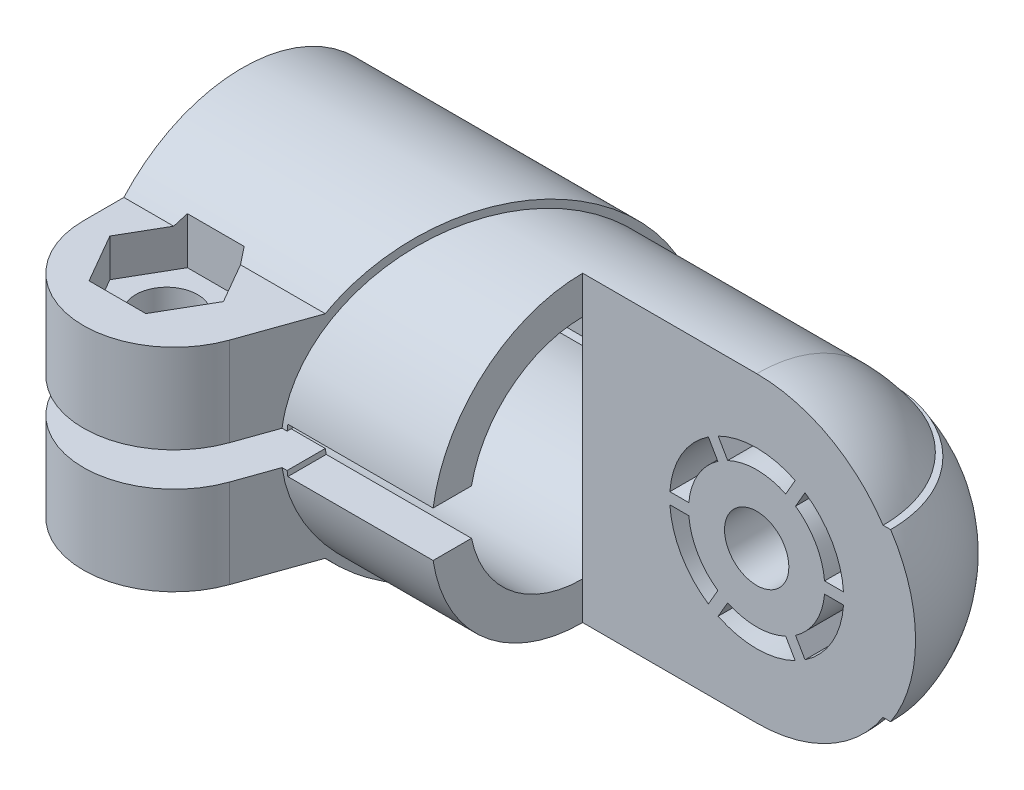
ISO-10303-21;
HEADER;
FILE_DESCRIPTION(('STEP AP214'),'2;1');
FILE_NAME('part.step','',(''),(''),'','','');
FILE_SCHEMA(('AUTOMOTIVE_DESIGN { 1 0 10303 214 1 1 1 1 }'));
ENDSEC;
DATA;
#1=APPLICATION_CONTEXT('core data for automotive mechanical design processes');
#2=APPLICATION_PROTOCOL_DEFINITION('international standard','automotive_design',2000,#1);
#3=PRODUCT_CONTEXT('',#1,'mechanical');
#4=PRODUCT('Part','Part','',(#3));
#5=PRODUCT_RELATED_PRODUCT_CATEGORY('part','',(#4));
#6=PRODUCT_DEFINITION_FORMATION('','',#4);
#7=PRODUCT_DEFINITION_CONTEXT('part definition',#1,'design');
#8=PRODUCT_DEFINITION('design','',#6,#7);
#9=PRODUCT_DEFINITION_SHAPE('','',#8);
#10=(LENGTH_UNIT() NAMED_UNIT(*) SI_UNIT(.MILLI.,.METRE.));
#11=(NAMED_UNIT(*) PLANE_ANGLE_UNIT() SI_UNIT($,.RADIAN.));
#12=(NAMED_UNIT(*) SI_UNIT($,.STERADIAN.) SOLID_ANGLE_UNIT());
#13=UNCERTAINTY_MEASURE_WITH_UNIT(LENGTH_MEASURE(1.E-05),#10,'distance_accuracy_value','');
#14=(GEOMETRIC_REPRESENTATION_CONTEXT(3) GLOBAL_UNCERTAINTY_ASSIGNED_CONTEXT((#13)) GLOBAL_UNIT_ASSIGNED_CONTEXT((#10,
#11,#12)) REPRESENTATION_CONTEXT('',''));
#15=CARTESIAN_POINT('',(0.,0.,0.));
#16=DIRECTION('',(0.,0.,1.));
#17=DIRECTION('',(1.,0.,0.));
#18=AXIS2_PLACEMENT_3D('',#15,#16,#17);
#19=CARTESIAN_POINT('',(0.,0.,0.));
#20=DIRECTION('',(1.,0.,0.));
#21=DIRECTION('',(0.,1.,0.));
#22=AXIS2_PLACEMENT_3D('',#19,#20,#21);
#23=PLANE('',#22);
#24=DIRECTION('',(0.,-1.,0.));
#25=VECTOR('',#24,1.);
#26=CARTESIAN_POINT('',(1.39645239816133E-13,-20.,0.));
#27=LINE('',#26,#25);
#28=CARTESIAN_POINT('',(-1.39645239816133E-13,20.,0.));
#29=VERTEX_POINT('',#28);
#30=CARTESIAN_POINT('',(-1.047339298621E-13,15.,0.));
#31=VERTEX_POINT('',#30);
#32=EDGE_CURVE('E26',#29,#31,#27,.T.);
#33=ORIENTED_EDGE('',*,*,#32,.F.);
#34=CARTESIAN_POINT('',(0.,0.,0.));
#35=DIRECTION('',(-1.,0.,0.));
#36=DIRECTION('',(0.,0.,1.));
#37=AXIS2_PLACEMENT_3D('',#34,#35,#36);
#38=CIRCLE('',#37,20.);
#39=CARTESIAN_POINT('',(0.,2.99999999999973,19.7737199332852));
#40=VERTEX_POINT('',#39);
#41=EDGE_CURVE('E1287',#40,#29,#38,.T.);
#42=ORIENTED_EDGE('',*,*,#41,.F.);
#43=DIRECTION('',(0.,0.,-1.));
#44=VECTOR('',#43,1.);
#45=CARTESIAN_POINT('',(0.,3.00000000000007,18.6603858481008));
#46=LINE('',#45,#44);
#47=CARTESIAN_POINT('',(0.,3.00000000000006,14.6969384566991));
#48=VERTEX_POINT('',#47);
#49=EDGE_CURVE('E876',#40,#48,#46,.T.);
#50=ORIENTED_EDGE('',*,*,#49,.T.);
#51=CARTESIAN_POINT('',(0.,0.,0.));
#52=DIRECTION('',(-1.,0.,0.));
#53=DIRECTION('',(0.,0.200000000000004,0.97979589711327));
#54=AXIS2_PLACEMENT_3D('',#51,#52,#53);
#55=CIRCLE('',#54,15.);
#56=EDGE_CURVE('E873',#48,#31,#55,.T.);
#57=ORIENTED_EDGE('',*,*,#56,.T.);
#58=EDGE_LOOP('',(#33,#42,#50,#57));
#59=FACE_BOUND('',#58,.T.);
#60=ADVANCED_FACE('F14',(#59),#23,.T.);
#61=CARTESIAN_POINT('',(1.047339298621E-13,-15.,0.));
#62=VERTEX_POINT('',#61);
#63=CARTESIAN_POINT('',(0.,-20.,0.));
#64=VERTEX_POINT('',#63);
#65=EDGE_CURVE('E9',#62,#64,#27,.T.);
#66=ORIENTED_EDGE('',*,*,#65,.F.);
#67=CARTESIAN_POINT('',(0.,0.,0.));
#68=DIRECTION('',(-1.,0.,0.));
#69=DIRECTION('',(0.,-1.,0.));
#70=AXIS2_PLACEMENT_3D('',#67,#68,#69);
#71=CIRCLE('',#70,15.);
#72=CARTESIAN_POINT('',(0.,-2.99999999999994,14.6969384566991));
#73=VERTEX_POINT('',#72);
#74=EDGE_CURVE('E886',#62,#73,#71,.T.);
#75=ORIENTED_EDGE('',*,*,#74,.T.);
#76=DIRECTION('',(0.,0.,1.));
#77=VECTOR('',#76,1.);
#78=CARTESIAN_POINT('',(0.,-2.99999999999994,14.6969384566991));
#79=LINE('',#78,#77);
#80=CARTESIAN_POINT('',(0.,-3.,19.7737199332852));
#81=VERTEX_POINT('',#80);
#82=EDGE_CURVE('E881',#81,#73,#79,.F.);
#83=ORIENTED_EDGE('',*,*,#82,.F.);
#84=EDGE_CURVE('E1292',#64,#81,#38,.T.);
#85=ORIENTED_EDGE('',*,*,#84,.F.);
#86=EDGE_LOOP('',(#66,#75,#83,#85));
#87=FACE_BOUND('',#86,.T.);
#88=ADVANCED_FACE('F1377',(#87),#23,.T.);
#89=CARTESIAN_POINT('',(-0.999999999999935,-9.,0.));
#90=DIRECTION('',(0.,-1.,0.));
#91=DIRECTION('',(1.,0.,0.));
#92=AXIS2_PLACEMENT_3D('',#89,#90,#91);
#93=PLANE('',#92);
#94=CARTESIAN_POINT('',(-34.,-9.00000000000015,21.));
#95=DIRECTION('',(0.,-1.,0.));
#96=DIRECTION('',(1.,0.,0.));
#97=AXIS2_PLACEMENT_3D('',#94,#95,#96);
#98=CIRCLE('',#97,4.1);
#99=CARTESIAN_POINT('',(-29.9,-9.00000000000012,21.));
#100=VERTEX_POINT('',#99);
#101=EDGE_CURVE('E24',#100,#100,#98,.T.);
#102=ORIENTED_EDGE('',*,*,#101,.F.);
#103=EDGE_LOOP('',(#102));
#104=FACE_BOUND('',#103,.T.);
#105=DIRECTION('',(0.499999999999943,0.,0.866025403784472));
#106=VECTOR('',#105,1.);
#107=CARTESIAN_POINT('',(-30.247223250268,-9.00000000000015,14.5));
#108=LINE('',#107,#106);
#109=CARTESIAN_POINT('',(-30.247223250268,-9.00000000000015,14.5));
#110=VERTEX_POINT('',#109);
#111=CARTESIAN_POINT('',(-26.494446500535,-9.0000000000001,21.));
#112=VERTEX_POINT('',#111);
#113=EDGE_CURVE('E906',#110,#112,#108,.T.);
#114=ORIENTED_EDGE('',*,*,#113,.T.);
#115=DIRECTION('',(-0.499999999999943,0.,0.866025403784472));
#116=VECTOR('',#115,1.);
#117=CARTESIAN_POINT('',(-26.494446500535,-9.0000000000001,21.));
#118=LINE('',#117,#116);
#119=CARTESIAN_POINT('',(-30.2472232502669,-9.0000000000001,27.5));
#120=VERTEX_POINT('',#119);
#121=EDGE_CURVE('E909',#112,#120,#118,.T.);
#122=ORIENTED_EDGE('',*,*,#121,.T.);
#123=DIRECTION('',(-1.,0.,0.));
#124=VECTOR('',#123,1.);
#125=CARTESIAN_POINT('',(-30.2472232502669,-9.0000000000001,27.5));
#126=LINE('',#125,#124);
#127=CARTESIAN_POINT('',(-37.7527767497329,-9.00000000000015,27.5));
#128=VERTEX_POINT('',#127);
#129=EDGE_CURVE('E912',#120,#128,#126,.T.);
#130=ORIENTED_EDGE('',*,*,#129,.T.);
#131=DIRECTION('',(-0.499999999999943,0.,-0.866025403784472));
#132=VECTOR('',#131,1.);
#133=CARTESIAN_POINT('',(-37.7527767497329,-9.00000000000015,27.5));
#134=LINE('',#133,#132);
#135=CARTESIAN_POINT('',(-41.505553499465,-9.0000000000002,21.));
#136=VERTEX_POINT('',#135);
#137=EDGE_CURVE('E915',#128,#136,#134,.T.);
#138=ORIENTED_EDGE('',*,*,#137,.T.);
#139=DIRECTION('',(0.499999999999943,0.,-0.866025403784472));
#140=VECTOR('',#139,1.);
#141=CARTESIAN_POINT('',(-41.505553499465,-9.0000000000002,21.));
#142=LINE('',#141,#140);
#143=CARTESIAN_POINT('',(-37.7527767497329,-9.0000000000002,14.5));
#144=VERTEX_POINT('',#143);
#145=EDGE_CURVE('E918',#136,#144,#142,.T.);
#146=ORIENTED_EDGE('',*,*,#145,.T.);
#147=DIRECTION('',(1.,0.,0.));
#148=VECTOR('',#147,1.);
#149=CARTESIAN_POINT('',(-37.7527767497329,-9.0000000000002,14.5));
#150=LINE('',#149,#148);
#151=EDGE_CURVE('E921',#144,#110,#150,.T.);
#152=ORIENTED_EDGE('',*,*,#151,.T.);
#153=EDGE_LOOP('',(#114,#122,#130,#138,#146,#152));
#154=FACE_BOUND('',#153,.T.);
#155=ADVANCED_FACE('F1385',(#104,#154),#93,.T.);
#156=CARTESIAN_POINT('',(-26.4944465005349,-14.,21.));
#157=DIRECTION('',(-0.866025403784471,0.,-0.499999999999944));
#158=DIRECTION('',(-0.499999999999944,0.,0.866025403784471));
#159=AXIS2_PLACEMENT_3D('',#156,#157,#158);
#160=PLANE('',#159);
#161=DIRECTION('',(0.499999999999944,0.,-0.866025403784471));
#162=VECTOR('',#161,1.);
#163=CARTESIAN_POINT('',(-30.247223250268,-14.,27.5));
#164=LINE('',#163,#162);
#165=CARTESIAN_POINT('',(-26.4944465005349,-14.,21.));
#166=VERTEX_POINT('',#165);
#167=CARTESIAN_POINT('',(-30.247223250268,-14.,27.5));
#168=VERTEX_POINT('',#167);
#169=EDGE_CURVE('E1230',#166,#168,#164,.F.);
#170=ORIENTED_EDGE('',*,*,#169,.T.);
#171=DIRECTION('',(0.,1.,0.));
#172=VECTOR('',#171,1.);
#173=CARTESIAN_POINT('',(-30.247223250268,-14.,27.5));
#174=LINE('',#173,#172);
#175=EDGE_CURVE('E2021',#120,#168,#174,.F.);
#176=ORIENTED_EDGE('',*,*,#175,.F.);
#177=ORIENTED_EDGE('',*,*,#121,.F.);
#178=DIRECTION('',(0.,-1.,0.));
#179=VECTOR('',#178,1.);
#180=CARTESIAN_POINT('',(-26.494446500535,-10.,21.));
#181=LINE('',#180,#179);
#182=EDGE_CURVE('E2019',#112,#166,#181,.T.);
#183=ORIENTED_EDGE('',*,*,#182,.T.);
#184=EDGE_LOOP('',(#170,#176,#177,#183));
#185=FACE_BOUND('',#184,.T.);
#186=ADVANCED_FACE('F1392',(#185),#160,.T.);
#187=CARTESIAN_POINT('',(-30.2472232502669,-10.,27.5));
#188=DIRECTION('',(0.,0.,-1.));
#189=DIRECTION('',(0.,-1.,0.));
#190=AXIS2_PLACEMENT_3D('',#187,#188,#189);
#191=PLANE('',#190);
#192=DIRECTION('',(1.,0.,0.));
#193=VECTOR('',#192,1.);
#194=CARTESIAN_POINT('',(-37.7527767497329,-14.0000000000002,27.5));
#195=LINE('',#194,#193);
#196=CARTESIAN_POINT('',(-37.7527767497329,-14.0000000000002,27.5));
#197=VERTEX_POINT('',#196);
#198=EDGE_CURVE('E1226',#168,#197,#195,.F.);
#199=ORIENTED_EDGE('',*,*,#198,.T.);
#200=DIRECTION('',(0.,-1.,0.));
#201=VECTOR('',#200,1.);
#202=CARTESIAN_POINT('',(-37.7527767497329,-10.0000000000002,27.5));
#203=LINE('',#202,#201);
#204=EDGE_CURVE('E1291',#128,#197,#203,.T.);
#205=ORIENTED_EDGE('',*,*,#204,.F.);
#206=ORIENTED_EDGE('',*,*,#129,.F.);
#207=ORIENTED_EDGE('',*,*,#175,.T.);
#208=EDGE_LOOP('',(#199,#205,#206,#207));
#209=FACE_BOUND('',#208,.T.);
#210=ADVANCED_FACE('F1397',(#209),#191,.T.);
#211=CARTESIAN_POINT('',(-37.7527767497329,-14.0000000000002,27.5));
#212=DIRECTION('',(0.866025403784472,0.,-0.499999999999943));
#213=DIRECTION('',(-0.499999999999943,0.,-0.866025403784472));
#214=AXIS2_PLACEMENT_3D('',#211,#212,#213);
#215=PLANE('',#214);
#216=DIRECTION('',(0.499999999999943,0.,0.866025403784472));
#217=VECTOR('',#216,1.);
#218=CARTESIAN_POINT('',(-41.5055534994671,-14.0000000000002,21.));
#219=LINE('',#218,#217);
#220=CARTESIAN_POINT('',(-41.5055534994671,-14.0000000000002,21.));
#221=VERTEX_POINT('',#220);
#222=EDGE_CURVE('E1222',#197,#221,#219,.F.);
#223=ORIENTED_EDGE('',*,*,#222,.T.);
#224=DIRECTION('',(0.,-1.,0.));
#225=VECTOR('',#224,1.);
#226=CARTESIAN_POINT('',(-41.505553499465,-10.0000000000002,21.));
#227=LINE('',#226,#225);
#228=EDGE_CURVE('E1294',#136,#221,#227,.T.);
#229=ORIENTED_EDGE('',*,*,#228,.F.);
#230=ORIENTED_EDGE('',*,*,#137,.F.);
#231=ORIENTED_EDGE('',*,*,#204,.T.);
#232=EDGE_LOOP('',(#223,#229,#230,#231));
#233=FACE_BOUND('',#232,.T.);
#234=ADVANCED_FACE('F1987',(#233),#215,.T.);
#235=CARTESIAN_POINT('',(-41.5055534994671,-15.1904575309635,21.));
#236=DIRECTION('',(0.866025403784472,0.,0.499999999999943));
#237=DIRECTION('',(0.499999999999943,0.,-0.866025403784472));
#238=AXIS2_PLACEMENT_3D('',#235,#236,#237);
#239=PLANE('',#238);
#240=CARTESIAN_POINT('',(-38.4181588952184,-14.0000001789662,15.6524756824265));
#241=CARTESIAN_POINT('',(-38.2054929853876,-14.4118259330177,15.2841275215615));
#242=CARTESIAN_POINT('',(-37.9835262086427,-14.8089540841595,14.8996697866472));
#243=CARTESIAN_POINT('',(-37.7527767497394,-15.1904575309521,14.5000000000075));
#244=B_SPLINE_CURVE_WITH_KNOTS('',3,(#240,#241,#242,#243),.UNSPECIFIED.,.F.,.F.,(4,4),(0.,1.),.UNSPECIFIED.);
#245=CARTESIAN_POINT('',(-38.4181588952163,-14.0000001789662,15.6524756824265));
#246=VERTEX_POINT('',#245);
#247=CARTESIAN_POINT('',(-37.7527767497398,-15.1904575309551,14.5000000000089));
#248=VERTEX_POINT('',#247);
#249=EDGE_CURVE('E1092',#246,#248,#244,.T.);
#250=ORIENTED_EDGE('',*,*,#249,.T.);
#251=DIRECTION('',(-1.32088929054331E-12,-1.,0.));
#252=VECTOR('',#251,1.);
#253=CARTESIAN_POINT('',(-37.7527767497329,-10.0000000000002,14.5));
#254=LINE('',#253,#252);
#255=EDGE_CURVE('E2025',#144,#248,#254,.T.);
#256=ORIENTED_EDGE('',*,*,#255,.F.);
#257=ORIENTED_EDGE('',*,*,#145,.F.);
#258=ORIENTED_EDGE('',*,*,#228,.T.);
#259=DIRECTION('',(-0.499999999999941,0.,0.866025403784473));
#260=VECTOR('',#259,1.);
#261=CARTESIAN_POINT('',(-38.4181588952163,-14.0000000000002,15.6524756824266));
#262=LINE('',#261,#260);
#263=EDGE_CURVE('E1218',#221,#246,#262,.F.);
#264=ORIENTED_EDGE('',*,*,#263,.T.);
#265=EDGE_LOOP('',(#250,#256,#257,#258,#264));
#266=FACE_BOUND('',#265,.T.);
#267=ADVANCED_FACE('F1991',(#266),#239,.T.);
#268=CARTESIAN_POINT('',(-30.2472232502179,-15.190457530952,14.5));
#269=DIRECTION('',(0.,0.,1.));
#270=DIRECTION('',(0.,1.,0.));
#271=AXIS2_PLACEMENT_3D('',#268,#269,#270);
#272=PLANE('',#271);
#273=DIRECTION('',(-1.,-9.67670437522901E-12,-1.01302857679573E-11));
#274=VECTOR('',#273,1.);
#275=CARTESIAN_POINT('',(-30.2472232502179,-15.1904575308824,14.5000000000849));
#276=LINE('',#275,#274);
#277=CARTESIAN_POINT('',(-30.2472232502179,-15.1904575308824,14.5000000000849));
#278=VERTEX_POINT('',#277);
#279=EDGE_CURVE('E1061',#248,#278,#276,.F.);
#280=ORIENTED_EDGE('',*,*,#279,.T.);
#281=DIRECTION('',(-9.44582748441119E-12,1.,0.));
#282=VECTOR('',#281,1.);
#283=CARTESIAN_POINT('',(-30.2472232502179,-15.1904575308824,14.5));
#284=LINE('',#283,#282);
#285=EDGE_CURVE('E2029',#110,#278,#284,.F.);
#286=ORIENTED_EDGE('',*,*,#285,.F.);
#287=ORIENTED_EDGE('',*,*,#151,.F.);
#288=ORIENTED_EDGE('',*,*,#255,.T.);
#289=EDGE_LOOP('',(#280,#286,#287,#288));
#290=FACE_BOUND('',#289,.T.);
#291=ADVANCED_FACE('F1996',(#290),#272,.T.);
#292=CARTESIAN_POINT('',(-30.2472232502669,-15.1904575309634,14.5));
#293=DIRECTION('',(-0.866025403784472,0.,0.499999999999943));
#294=DIRECTION('',(0.499999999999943,0.,0.866025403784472));
#295=AXIS2_PLACEMENT_3D('',#292,#293,#294);
#296=PLANE('',#295);
#297=CARTESIAN_POINT('',(-30.2472232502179,-15.1904575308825,14.5000000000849));
#298=CARTESIAN_POINT('',(-30.0164737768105,-14.8089540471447,14.8996698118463));
#299=CARTESIAN_POINT('',(-29.794506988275,-14.4118258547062,15.2841275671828));
#300=CARTESIAN_POINT('',(-29.581841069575,-14.0000000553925,15.6524757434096));
#301=B_SPLINE_CURVE_WITH_KNOTS('',3,(#297,#298,#299,#300),.UNSPECIFIED.,.F.,.F.,(4,4),(0.,1.),.UNSPECIFIED.);
#302=CARTESIAN_POINT('',(-29.581841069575,-14.0000000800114,15.6524757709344));
#303=VERTEX_POINT('',#302);
#304=EDGE_CURVE('E1072',#278,#303,#301,.T.);
#305=ORIENTED_EDGE('',*,*,#304,.T.);
#306=DIRECTION('',(-0.499999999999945,0.,-0.866025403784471));
#307=VECTOR('',#306,1.);
#308=CARTESIAN_POINT('',(-26.4944465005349,-14.,21.));
#309=LINE('',#308,#307);
#310=EDGE_CURVE('E1202',#303,#166,#309,.F.);
#311=ORIENTED_EDGE('',*,*,#310,.T.);
#312=ORIENTED_EDGE('',*,*,#182,.F.);
#313=ORIENTED_EDGE('',*,*,#113,.F.);
#314=ORIENTED_EDGE('',*,*,#285,.T.);
#315=EDGE_LOOP('',(#305,#311,#312,#313,#314));
#316=FACE_BOUND('',#315,.T.);
#317=ADVANCED_FACE('F1368',(#316),#296,.T.);
#318=CARTESIAN_POINT('',(-30.2472232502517,9.99999999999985,14.5));
#319=DIRECTION('',(0.,0.,1.));
#320=DIRECTION('',(0.,1.,0.));
#321=AXIS2_PLACEMENT_3D('',#318,#319,#320);
#322=PLANE('',#321);
#323=DIRECTION('',(1.,-1.53807419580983E-11,1.61202257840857E-11));
#324=VECTOR('',#323,1.);
#325=CARTESIAN_POINT('',(-37.7527767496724,15.1904575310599,14.4999999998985));
#326=LINE('',#325,#324);
#327=CARTESIAN_POINT('',(-30.2472232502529,15.1904575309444,14.5000000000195));
#328=VERTEX_POINT('',#327);
#329=CARTESIAN_POINT('',(-37.7527767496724,15.1904575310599,14.4999999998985));
#330=VERTEX_POINT('',#329);
#331=EDGE_CURVE('E1119',#328,#330,#326,.F.);
#332=ORIENTED_EDGE('',*,*,#331,.T.);
#333=DIRECTION('',(-1.1270348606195E-11,-1.,0.));
#334=VECTOR('',#333,1.);
#335=CARTESIAN_POINT('',(-37.7527767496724,15.1904575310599,14.5));
#336=LINE('',#335,#334);
#337=CARTESIAN_POINT('',(-37.7527767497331,9.99999999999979,14.5));
#338=VERTEX_POINT('',#337);
#339=EDGE_CURVE('E1130',#330,#338,#336,.T.);
#340=ORIENTED_EDGE('',*,*,#339,.T.);
#341=DIRECTION('',(0.,1.,0.));
#342=VECTOR('',#341,1.);
#343=CARTESIAN_POINT('',(-37.7527767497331,8.99999999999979,14.5));
#344=LINE('',#343,#342);
#345=CARTESIAN_POINT('',(-37.7527767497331,8.99999999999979,14.5));
#346=VERTEX_POINT('',#345);
#347=EDGE_CURVE('E945',#346,#338,#344,.T.);
#348=ORIENTED_EDGE('',*,*,#347,.F.);
#349=DIRECTION('',(-1.,0.,0.));
#350=VECTOR('',#349,1.);
#351=CARTESIAN_POINT('',(-30.2472232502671,8.99999999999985,14.5));
#352=LINE('',#351,#350);
#353=CARTESIAN_POINT('',(-30.2472232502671,8.99999999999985,14.5));
#354=VERTEX_POINT('',#353);
#355=EDGE_CURVE('E936',#354,#346,#352,.T.);
#356=ORIENTED_EDGE('',*,*,#355,.F.);
#357=DIRECTION('',(2.94582162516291E-12,1.,0.));
#358=VECTOR('',#357,1.);
#359=CARTESIAN_POINT('',(-30.2472232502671,9.99999999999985,14.5));
#360=LINE('',#359,#358);
#361=EDGE_CURVE('E1132',#328,#354,#360,.F.);
#362=ORIENTED_EDGE('',*,*,#361,.F.);
#363=EDGE_LOOP('',(#332,#340,#348,#356,#362));
#364=FACE_BOUND('',#363,.T.);
#365=ADVANCED_FACE('F1129',(#364),#322,.T.);
#366=CARTESIAN_POINT('',(-41.505553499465,9.99999999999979,21.));
#367=DIRECTION('',(0.866025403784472,0.,0.499999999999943));
#368=DIRECTION('',(0.499999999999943,0.,-0.866025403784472));
#369=AXIS2_PLACEMENT_3D('',#366,#367,#368);
#370=PLANE('',#369);
#371=CARTESIAN_POINT('',(-37.7527767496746,15.1904575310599,14.4999999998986));
#372=CARTESIAN_POINT('',(-37.983526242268,14.8089540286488,14.8996698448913));
#373=CARTESIAN_POINT('',(-38.2054930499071,14.4118258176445,15.2841276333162));
#374=CARTESIAN_POINT('',(-38.4181589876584,13.9999999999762,15.6524758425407));
#375=B_SPLINE_CURVE_WITH_KNOTS('',3,(#371,#372,#373,#374),.UNSPECIFIED.,.F.,.F.,(4,4),(0.,1.),.UNSPECIFIED.);
#376=CARTESIAN_POINT('',(-38.4181589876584,13.9999999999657,15.6524758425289));
#377=VERTEX_POINT('',#376);
#378=EDGE_CURVE('E1113',#330,#377,#375,.T.);
#379=ORIENTED_EDGE('',*,*,#378,.T.);
#380=DIRECTION('',(0.499999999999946,0.,-0.86602540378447));
#381=VECTOR('',#380,1.);
#382=CARTESIAN_POINT('',(-41.5055534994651,13.9999999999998,21.));
#383=LINE('',#382,#381);
#384=CARTESIAN_POINT('',(-41.5055534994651,13.9999999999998,21.));
#385=VERTEX_POINT('',#384);
#386=EDGE_CURVE('E1252',#385,#377,#383,.T.);
#387=ORIENTED_EDGE('',*,*,#386,.F.);
#388=DIRECTION('',(0.,-1.,0.));
#389=VECTOR('',#388,1.);
#390=CARTESIAN_POINT('',(-41.5055534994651,13.9999999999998,21.));
#391=LINE('',#390,#389);
#392=CARTESIAN_POINT('',(-41.505553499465,8.99999999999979,21.));
#393=VERTEX_POINT('',#392);
#394=EDGE_CURVE('E2041',#385,#393,#391,.T.);
#395=ORIENTED_EDGE('',*,*,#394,.T.);
#396=DIRECTION('',(-0.499999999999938,0.,0.866025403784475));
#397=VECTOR('',#396,1.);
#398=CARTESIAN_POINT('',(-37.7527767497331,8.99999999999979,14.5));
#399=LINE('',#398,#397);
#400=EDGE_CURVE('E939',#346,#393,#399,.T.);
#401=ORIENTED_EDGE('',*,*,#400,.F.);
#402=ORIENTED_EDGE('',*,*,#347,.T.);
#403=ORIENTED_EDGE('',*,*,#339,.F.);
#404=EDGE_LOOP('',(#379,#387,#395,#401,#402,#403));
#405=FACE_BOUND('',#404,.T.);
#406=ADVANCED_FACE('F1363',(#405),#370,.T.);
#407=CARTESIAN_POINT('',(-37.7527767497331,9.99999999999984,27.5));
#408=DIRECTION('',(0.866025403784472,0.,-0.499999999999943));
#409=DIRECTION('',(-0.499999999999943,0.,-0.866025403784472));
#410=AXIS2_PLACEMENT_3D('',#407,#408,#409);
#411=PLANE('',#410);
#412=DIRECTION('',(0.,-1.,0.));
#413=VECTOR('',#412,1.);
#414=CARTESIAN_POINT('',(-37.7527767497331,13.9999999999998,27.5));
#415=LINE('',#414,#413);
#416=CARTESIAN_POINT('',(-37.7527767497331,13.9999999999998,27.5));
#417=VERTEX_POINT('',#416);
#418=CARTESIAN_POINT('',(-37.7527767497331,8.99999999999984,27.5));
#419=VERTEX_POINT('',#418);
#420=EDGE_CURVE('E2033',#417,#419,#415,.T.);
#421=ORIENTED_EDGE('',*,*,#420,.T.);
#422=DIRECTION('',(0.499999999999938,0.,0.866025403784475));
#423=VECTOR('',#422,1.);
#424=CARTESIAN_POINT('',(-41.505553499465,8.99999999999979,21.));
#425=LINE('',#424,#423);
#426=EDGE_CURVE('E942',#393,#419,#425,.T.);
#427=ORIENTED_EDGE('',*,*,#426,.F.);
#428=ORIENTED_EDGE('',*,*,#394,.F.);
#429=DIRECTION('',(-0.499999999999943,0.,-0.866025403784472));
#430=VECTOR('',#429,1.);
#431=CARTESIAN_POINT('',(-37.7527767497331,13.9999999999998,27.5));
#432=LINE('',#431,#430);
#433=EDGE_CURVE('E1247',#417,#385,#432,.T.);
#434=ORIENTED_EDGE('',*,*,#433,.F.);
#435=EDGE_LOOP('',(#421,#427,#428,#434));
#436=FACE_BOUND('',#435,.T.);
#437=ADVANCED_FACE('F2066',(#436),#411,.T.);
#438=CARTESIAN_POINT('',(-30.2472232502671,14.,27.5));
#439=DIRECTION('',(0.,0.,-1.));
#440=DIRECTION('',(0.,-1.,0.));
#441=AXIS2_PLACEMENT_3D('',#438,#439,#440);
#442=PLANE('',#441);
#443=DIRECTION('',(0.,1.,0.));
#444=VECTOR('',#443,1.);
#445=CARTESIAN_POINT('',(-30.2472232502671,9.99999999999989,27.5));
#446=LINE('',#445,#444);
#447=CARTESIAN_POINT('',(-30.2472232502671,14.,27.5));
#448=VERTEX_POINT('',#447);
#449=CARTESIAN_POINT('',(-30.2472232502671,8.99999999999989,27.5));
#450=VERTEX_POINT('',#449);
#451=EDGE_CURVE('E2037',#448,#450,#446,.F.);
#452=ORIENTED_EDGE('',*,*,#451,.T.);
#453=DIRECTION('',(1.,0.,0.));
#454=VECTOR('',#453,1.);
#455=CARTESIAN_POINT('',(-37.7527767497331,8.99999999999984,27.5));
#456=LINE('',#455,#454);
#457=EDGE_CURVE('E927',#419,#450,#456,.T.);
#458=ORIENTED_EDGE('',*,*,#457,.F.);
#459=ORIENTED_EDGE('',*,*,#420,.F.);
#460=DIRECTION('',(-1.,0.,0.));
#461=VECTOR('',#460,1.);
#462=CARTESIAN_POINT('',(-30.2472232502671,14.,27.5));
#463=LINE('',#462,#461);
#464=EDGE_CURVE('E1242',#448,#417,#463,.T.);
#465=ORIENTED_EDGE('',*,*,#464,.F.);
#466=EDGE_LOOP('',(#452,#458,#459,#465));
#467=FACE_BOUND('',#466,.T.);
#468=ADVANCED_FACE('F2063',(#467),#442,.T.);
#469=CARTESIAN_POINT('',(-26.4944465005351,10.,21.));
#470=DIRECTION('',(-0.866025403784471,0.,-0.499999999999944));
#471=DIRECTION('',(-0.499999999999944,0.,0.866025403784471));
#472=AXIS2_PLACEMENT_3D('',#469,#470,#471);
#473=PLANE('',#472);
#474=DIRECTION('',(0.,1.,0.));
#475=VECTOR('',#474,1.);
#476=CARTESIAN_POINT('',(-26.4944465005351,10.,21.));
#477=LINE('',#476,#475);
#478=CARTESIAN_POINT('',(-26.4944465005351,14.,21.));
#479=VERTEX_POINT('',#478);
#480=CARTESIAN_POINT('',(-26.4944465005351,8.99999999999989,21.));
#481=VERTEX_POINT('',#480);
#482=EDGE_CURVE('E1343',#479,#481,#477,.F.);
#483=ORIENTED_EDGE('',*,*,#482,.T.);
#484=DIRECTION('',(0.499999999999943,0.,-0.866025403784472));
#485=VECTOR('',#484,1.);
#486=CARTESIAN_POINT('',(-30.2472232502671,8.99999999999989,27.5));
#487=LINE('',#486,#485);
#488=EDGE_CURVE('E930',#450,#481,#487,.T.);
#489=ORIENTED_EDGE('',*,*,#488,.F.);
#490=ORIENTED_EDGE('',*,*,#451,.F.);
#491=DIRECTION('',(-0.499999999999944,0.,0.866025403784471));
#492=VECTOR('',#491,1.);
#493=CARTESIAN_POINT('',(-26.4944465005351,14.,21.));
#494=LINE('',#493,#492);
#495=EDGE_CURVE('E1238',#479,#448,#494,.T.);
#496=ORIENTED_EDGE('',*,*,#495,.F.);
#497=EDGE_LOOP('',(#483,#489,#490,#496));
#498=FACE_BOUND('',#497,.T.);
#499=ADVANCED_FACE('F1362',(#498),#473,.T.);
#500=CARTESIAN_POINT('',(-30.2472232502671,9.99999999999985,14.5));
#501=DIRECTION('',(-0.866025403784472,0.,0.499999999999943));
#502=DIRECTION('',(0.499999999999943,0.,0.866025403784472));
#503=AXIS2_PLACEMENT_3D('',#500,#501,#502);
#504=PLANE('',#503);
#505=CARTESIAN_POINT('',(-29.581841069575,14.0000001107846,15.6524757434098));
#506=CARTESIAN_POINT('',(-29.794506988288,14.4118258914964,15.2841275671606));
#507=CARTESIAN_POINT('',(-30.0164737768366,14.8089540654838,14.8996698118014));
#508=CARTESIAN_POINT('',(-30.2472232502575,15.1904575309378,14.5000000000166));
#509=B_SPLINE_CURVE_WITH_KNOTS('',3,(#505,#506,#507,#508),.UNSPECIFIED.,.F.,.F.,(4,4),(0.,1.),.UNSPECIFIED.);
#510=CARTESIAN_POINT('',(-29.5818410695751,14.0000001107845,15.6524757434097));
#511=VERTEX_POINT('',#510);
#512=EDGE_CURVE('E1133',#511,#328,#509,.T.);
#513=ORIENTED_EDGE('',*,*,#512,.T.);
#514=ORIENTED_EDGE('',*,*,#361,.T.);
#515=DIRECTION('',(-0.499999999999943,0.,-0.866025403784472));
#516=VECTOR('',#515,1.);
#517=CARTESIAN_POINT('',(-26.4944465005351,8.99999999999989,21.));
#518=LINE('',#517,#516);
#519=EDGE_CURVE('E933',#481,#354,#518,.T.);
#520=ORIENTED_EDGE('',*,*,#519,.F.);
#521=ORIENTED_EDGE('',*,*,#482,.F.);
#522=DIRECTION('',(0.499999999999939,0.,0.866025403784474));
#523=VECTOR('',#522,1.);
#524=CARTESIAN_POINT('',(-29.5818410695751,13.9999999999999,15.6524757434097));
#525=LINE('',#524,#523);
#526=EDGE_CURVE('E1146',#511,#479,#525,.T.);
#527=ORIENTED_EDGE('',*,*,#526,.F.);
#528=EDGE_LOOP('',(#513,#514,#520,#521,#527));
#529=FACE_BOUND('',#528,.T.);
#530=ADVANCED_FACE('F1351',(#529),#504,.T.);
#531=CARTESIAN_POINT('',(-1.00000000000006,9.,0.));
#532=DIRECTION('',(0.,1.,0.));
#533=DIRECTION('',(-1.,0.,0.));
#534=AXIS2_PLACEMENT_3D('',#531,#532,#533);
#535=PLANE('',#534);
#536=CARTESIAN_POINT('',(-34.,8.99999999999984,21.));
#537=DIRECTION('',(0.,1.,0.));
#538=DIRECTION('',(-1.,0.,0.));
#539=AXIS2_PLACEMENT_3D('',#536,#537,#538);
#540=CIRCLE('',#539,4.1);
#541=CARTESIAN_POINT('',(-38.1,8.99999999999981,21.));
#542=VERTEX_POINT('',#541);
#543=EDGE_CURVE('E924',#542,#542,#540,.T.);
#544=ORIENTED_EDGE('',*,*,#543,.F.);
#545=EDGE_LOOP('',(#544));
#546=FACE_BOUND('',#545,.T.);
#547=ORIENTED_EDGE('',*,*,#457,.T.);
#548=ORIENTED_EDGE('',*,*,#488,.T.);
#549=ORIENTED_EDGE('',*,*,#519,.T.);
#550=ORIENTED_EDGE('',*,*,#355,.T.);
#551=ORIENTED_EDGE('',*,*,#400,.T.);
#552=ORIENTED_EDGE('',*,*,#426,.T.);
#553=EDGE_LOOP('',(#547,#548,#549,#550,#551,#552));
#554=FACE_BOUND('',#553,.T.);
#555=ADVANCED_FACE('F1361',(#546,#554),#535,.T.);
#556=CARTESIAN_POINT('',(-34.0000000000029,100.,20.9999999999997));
#557=DIRECTION('',(0.,-1.,0.));
#558=DIRECTION('',(-1.,0.,0.));
#559=AXIS2_PLACEMENT_3D('',#556,#557,#558);
#560=CYLINDRICAL_SURFACE('',#559,4.1);
#561=CARTESIAN_POINT('',(-34.0000000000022,-2.25000000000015,21.));
#562=DIRECTION('',(0.,-1.,0.));
#563=DIRECTION('',(-1.,0.,0.));
#564=AXIS2_PLACEMENT_3D('',#561,#562,#563);
#565=CIRCLE('',#564,4.1);
#566=CARTESIAN_POINT('',(-38.1000000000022,-2.25000000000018,21.));
#567=VERTEX_POINT('',#566);
#568=EDGE_CURVE('E2215',#567,#567,#565,.T.);
#569=ORIENTED_EDGE('',*,*,#568,.F.);
#570=EDGE_LOOP('',(#569));
#571=FACE_BOUND('',#570,.T.);
#572=ORIENTED_EDGE('',*,*,#101,.T.);
#573=EDGE_LOOP('',(#572));
#574=FACE_BOUND('',#573,.T.);
#575=ADVANCED_FACE('F1405',(#571,#574),#560,.F.);
#576=CARTESIAN_POINT('',(-33.,13.9999999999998,21.));
#577=DIRECTION('',(0.,-1.,0.));
#578=DIRECTION('',(0.942661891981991,0.,0.333749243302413));
#579=AXIS2_PLACEMENT_3D('',#576,#577,#578);
#580=CYLINDRICAL_SURFACE('',#579,12.);
#581=CARTESIAN_POINT('',(-33.0000000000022,-2.25000000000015,21.));
#582=DIRECTION('',(0.,1.,0.));
#583=DIRECTION('',(-1.,0.,0.));
#584=AXIS2_PLACEMENT_3D('',#581,#582,#583);
#585=CIRCLE('',#584,12.);
#586=CARTESIAN_POINT('',(-45.0000000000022,-2.25000000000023,21.));
#587=VERTEX_POINT('',#586);
#588=CARTESIAN_POINT('',(-21.688057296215,-2.25000000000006,25.004990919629));
#589=VERTEX_POINT('',#588);
#590=EDGE_CURVE('E2203',#587,#589,#585,.T.);
#591=ORIENTED_EDGE('',*,*,#590,.F.);
#592=DIRECTION('',(0.,1.,0.));
#593=VECTOR('',#592,1.);
#594=CARTESIAN_POINT('',(-45.0000000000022,-14.0000000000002,21.));
#595=LINE('',#594,#593);
#596=CARTESIAN_POINT('',(-45.0000000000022,-14.0000000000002,21.));
#597=VERTEX_POINT('',#596);
#598=EDGE_CURVE('E2218',#587,#597,#595,.F.);
#599=ORIENTED_EDGE('',*,*,#598,.T.);
#600=CARTESIAN_POINT('',(-33.0000000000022,-14.0000000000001,21.));
#601=DIRECTION('',(0.,-1.,0.));
#602=DIRECTION('',(0.942661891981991,0.,0.333749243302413));
#603=AXIS2_PLACEMENT_3D('',#600,#601,#602);
#604=CIRCLE('',#603,12.);
#605=CARTESIAN_POINT('',(-21.6880572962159,-14.,25.004990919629));
#606=VERTEX_POINT('',#605);
#607=EDGE_CURVE('E1205',#597,#606,#604,.F.);
#608=ORIENTED_EDGE('',*,*,#607,.T.);
#609=DIRECTION('',(0.,-1.,0.));
#610=VECTOR('',#609,1.);
#611=CARTESIAN_POINT('',(-21.6880572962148,-2.25000000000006,25.004990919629));
#612=LINE('',#611,#610);
#613=EDGE_CURVE('E1330',#589,#606,#612,.T.);
#614=ORIENTED_EDGE('',*,*,#613,.F.);
#615=EDGE_LOOP('',(#591,#599,#608,#614));
#616=FACE_BOUND('',#615,.T.);
#617=ADVANCED_FACE('F1982',(#616),#580,.T.);
#618=CARTESIAN_POINT('',(-18.3768012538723,-14.,15.6524756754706));
#619=DIRECTION('',(0.,-1.,0.));
#620=DIRECTION('',(0.,0.,1.));
#621=AXIS2_PLACEMENT_3D('',#618,#619,#620);
#622=PLANE('',#621);
#623=ORIENTED_EDGE('',*,*,#310,.F.);
#624=DIRECTION('',(-1.,9.52532434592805E-09,8.51971527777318E-09));
#625=VECTOR('',#624,1.);
#626=CARTESIAN_POINT('',(-18.3768012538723,-14.000000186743,15.6524756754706));
#627=LINE('',#626,#625);
#628=CARTESIAN_POINT('',(-18.3768012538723,-14.000000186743,15.6524756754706));
#629=VERTEX_POINT('',#628);
#630=EDGE_CURVE('E1076',#303,#629,#627,.F.);
#631=ORIENTED_EDGE('',*,*,#630,.T.);
#632=DIRECTION('',(-0.333749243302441,0.,0.942661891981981));
#633=VECTOR('',#632,1.);
#634=CARTESIAN_POINT('',(-18.3768012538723,-14.,15.6524756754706));
#635=LINE('',#634,#633);
#636=EDGE_CURVE('E1203',#606,#629,#635,.F.);
#637=ORIENTED_EDGE('',*,*,#636,.F.);
#638=ORIENTED_EDGE('',*,*,#607,.F.);
#639=DIRECTION('',(0.,0.,-1.));
#640=VECTOR('',#639,1.);
#641=CARTESIAN_POINT('',(-45.0000000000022,-14.0000000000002,21.));
#642=LINE('',#641,#640);
#643=CARTESIAN_POINT('',(-45.,-14.0000000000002,15.6524758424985));
#644=VERTEX_POINT('',#643);
#645=EDGE_CURVE('E1213',#644,#597,#642,.F.);
#646=ORIENTED_EDGE('',*,*,#645,.F.);
#647=DIRECTION('',(-1.,2.71908610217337E-08,2.43202516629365E-08));
#648=VECTOR('',#647,1.);
#649=CARTESIAN_POINT('',(-38.4181588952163,-14.0000001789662,15.6524756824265));
#650=LINE('',#649,#648);
#651=EDGE_CURVE('E1095',#644,#246,#650,.F.);
#652=ORIENTED_EDGE('',*,*,#651,.T.);
#653=ORIENTED_EDGE('',*,*,#263,.F.);
#654=ORIENTED_EDGE('',*,*,#222,.F.);
#655=ORIENTED_EDGE('',*,*,#198,.F.);
#656=ORIENTED_EDGE('',*,*,#169,.F.);
#657=EDGE_LOOP('',(#623,#631,#637,#638,#646,#652,#653,#654,#655,#656));
#658=FACE_BOUND('',#657,.T.);
#659=ADVANCED_FACE('F1021',(#658),#622,.T.);
#660=CARTESIAN_POINT('',(-45.,-3.07250357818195E-13,0.));
#661=DIRECTION('',(-1.,0.,0.));
#662=DIRECTION('',(0.,3.12283532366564E-12,-1.));
#663=AXIS2_PLACEMENT_3D('',#660,#661,#662);
#664=CYLINDRICAL_SURFACE('',#663,21.);
#665=ORIENTED_EDGE('',*,*,#651,.F.);
#666=CARTESIAN_POINT('',(-45.,-3.07250357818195E-13,0.));
#667=DIRECTION('',(1.,0.,0.));
#668=DIRECTION('',(0.,-0.666666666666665,0.745355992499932));
#669=AXIS2_PLACEMENT_3D('',#666,#667,#668);
#670=CIRCLE('',#669,21.);
#671=CARTESIAN_POINT('',(-45.,13.9999999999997,15.6524758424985));
#672=VERTEX_POINT('',#671);
#673=EDGE_CURVE('E1100',#672,#644,#670,.F.);
#674=ORIENTED_EDGE('',*,*,#673,.F.);
#675=DIRECTION('',(1.,-5.16838038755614E-12,4.62911098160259E-12));
#676=VECTOR('',#675,1.);
#677=CARTESIAN_POINT('',(-45.,13.9999999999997,15.6524758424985));
#678=LINE('',#677,#676);
#679=EDGE_CURVE('E1104',#672,#377,#678,.T.);
#680=ORIENTED_EDGE('',*,*,#679,.T.);
#681=ORIENTED_EDGE('',*,*,#378,.F.);
#682=ORIENTED_EDGE('',*,*,#331,.F.);
#683=ORIENTED_EDGE('',*,*,#512,.F.);
#684=DIRECTION('',(1.,-9.62312259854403E-09,8.60718865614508E-09));
#685=VECTOR('',#684,1.);
#686=CARTESIAN_POINT('',(-29.5818410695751,14.0000001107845,15.6524757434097));
#687=LINE('',#686,#685);
#688=CARTESIAN_POINT('',(-18.3768013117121,14.000000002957,15.6524758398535));
#689=VERTEX_POINT('',#688);
#690=EDGE_CURVE('E1134',#511,#689,#687,.T.);
#691=ORIENTED_EDGE('',*,*,#690,.T.);
#692=CARTESIAN_POINT('',(-5.96064221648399,8.00000048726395,-19.4164876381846));
#693=CARTESIAN_POINT('',(-6.30627257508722,10.3693449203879,-18.4402679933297));
#694=CARTESIAN_POINT('',(-6.80252068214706,12.5400055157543,-17.0386343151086));
#695=CARTESIAN_POINT('',(-7.98592250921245,16.0857868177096,-13.6961614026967));
#696=CARTESIAN_POINT('',(-8.64198947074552,17.4955904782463,-11.8431255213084));
#697=CARTESIAN_POINT('',(-10.1077021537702,19.679461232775,-7.70327646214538));
#698=CARTESIAN_POINT('',(-10.9111121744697,20.4262796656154,-5.434075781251));
#699=CARTESIAN_POINT('',(-12.4348270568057,21.0603345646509,-1.13040174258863));
#700=CARTESIAN_POINT('',(-13.1247575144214,21.073127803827,0.818280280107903));
#701=CARTESIAN_POINT('',(-14.480789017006,20.5700766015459,4.64833906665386));
#702=CARTESIAN_POINT('',(-15.1468900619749,20.0542321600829,6.52971583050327));
#703=CARTESIAN_POINT('',(-16.4662352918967,18.4458794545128,10.2561556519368));
#704=CARTESIAN_POINT('',(-17.1035104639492,17.3241699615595,12.0561148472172));
#705=CARTESIAN_POINT('',(-17.920825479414,15.3469544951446,14.3645896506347));
#706=CARTESIAN_POINT('',(-18.1567529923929,14.694878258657,15.0309578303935));
#707=CARTESIAN_POINT('',(-18.3768013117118,14.0000000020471,15.6524758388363));
#708=B_SPLINE_CURVE_WITH_KNOTS('',3,(#692,#693,#694,#695,#696,#697,#698,#699,#700,#701,#702,
#703,#704,#705,#706,#707),.UNSPECIFIED.,.F.,.F.,(4,2,2,2,2,2,2,4),(0.,0.182064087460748,
0.346202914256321,0.514740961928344,0.651339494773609,0.787938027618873,0.93539626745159,1.),.UNSPECIFIED.);
#709=CARTESIAN_POINT('',(-5.96064214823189,8.00000001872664,-19.4164878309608));
#710=VERTEX_POINT('',#709);
#711=EDGE_CURVE('E1150',#710,#689,#708,.T.);
#712=ORIENTED_EDGE('',*,*,#711,.F.);
#713=CARTESIAN_POINT('',(-12.8350455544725,0.,0.));
#714=DIRECTION('',(0.942661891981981,0.,0.333749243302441));
#715=DIRECTION('',(-0.333749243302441,0.,0.942661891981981));
#716=AXIS2_PLACEMENT_3D('',#713,#714,#715);
#717=ELLIPSE('',#716,22.2773405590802,20.9999999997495);
#718=CARTESIAN_POINT('',(-5.75404978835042,6.40312423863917,-19.9999999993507));
#719=VERTEX_POINT('',#718);
#720=EDGE_CURVE('E988',#719,#710,#717,.T.);
#721=ORIENTED_EDGE('',*,*,#720,.F.);
#722=CARTESIAN_POINT('',(-5.39999993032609,4.21598519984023E-11,-21.0000001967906));
#723=CARTESIAN_POINT('',(-5.39999948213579,0.235321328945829,-21.0000014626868));
#724=CARTESIAN_POINT('',(-5.40139425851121,0.470700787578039,-20.9960619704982));
#725=CARTESIAN_POINT('',(-5.40761661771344,0.994674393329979,-20.9784871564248));
#726=CARTESIAN_POINT('',(-5.41315343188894,1.28296759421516,-20.9628486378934));
#727=CARTESIAN_POINT('',(-5.42832038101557,1.85415603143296,-20.9200101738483));
#728=CARTESIAN_POINT('',(-5.4378872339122,2.13706687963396,-20.8929889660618));
#729=CARTESIAN_POINT('',(-5.4692588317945,2.90044904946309,-20.8043810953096));
#730=CARTESIAN_POINT('',(-5.4939391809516,3.35868244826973,-20.7346723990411));
#731=CARTESIAN_POINT('',(-5.56433800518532,4.43787085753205,-20.5358336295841));
#732=CARTESIAN_POINT('',(-5.61372400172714,5.03587941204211,-20.3963447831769));
#733=CARTESIAN_POINT('',(-5.69693187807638,5.88187407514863,-20.1613273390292));
#734=CARTESIAN_POINT('',(-5.72458494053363,6.14318059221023,-20.0832223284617));
#735=CARTESIAN_POINT('',(-5.75404978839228,6.40312423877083,-19.999999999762));
#736=B_SPLINE_CURVE_WITH_KNOTS('',3,(#722,#723,#724,#725,#726,#727,#728,#729,#730,#731,#732,
#733,#734,#735),.UNSPECIFIED.,.F.,.F.,(4,2,2,2,2,2,4),(0.,0.103072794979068,0.229661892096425,
0.3543332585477,0.566663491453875,0.865452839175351,1.),.UNSPECIFIED.);
#737=CARTESIAN_POINT('',(-5.39999937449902,4.21587706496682E-11,-21.));
#738=VERTEX_POINT('',#737);
#739=EDGE_CURVE('E1151',#738,#719,#736,.T.);
#740=ORIENTED_EDGE('',*,*,#739,.F.);
#741=CARTESIAN_POINT('',(-5.75405018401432,-6.40312772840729,-19.9999988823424));
#742=CARTESIAN_POINT('',(-5.69550772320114,-5.88665668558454,-20.1653498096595));
#743=CARTESIAN_POINT('',(-5.6440702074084,-5.3639745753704,-20.3106330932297));
#744=CARTESIAN_POINT('',(-5.55660247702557,-4.32006875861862,-20.5576823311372));
#745=CARTESIAN_POINT('',(-5.51959890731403,-3.79292233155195,-20.6621974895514));
#746=CARTESIAN_POINT('',(-5.47180208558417,-2.92849746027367,-20.7971977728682));
#747=CARTESIAN_POINT('',(-5.45705833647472,-2.61600280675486,-20.8388409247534));
#748=CARTESIAN_POINT('',(-5.43093792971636,-1.94778737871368,-20.9126170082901));
#749=CARTESIAN_POINT('',(-5.42010246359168,-1.58844565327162,-20.9432213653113));
#750=CARTESIAN_POINT('',(-5.40416993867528,-0.813335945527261,-20.9882221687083));
#751=CARTESIAN_POINT('',(-5.40000065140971,-0.406754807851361,-20.9999981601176));
#752=CARTESIAN_POINT('',(-5.39999993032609,4.21598519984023E-11,-21.0000001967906));
#753=B_SPLINE_CURVE_WITH_KNOTS('',3,(#741,#742,#743,#744,#745,#746,#747,#748,#749,#750,#751,
#752),.UNSPECIFIED.,.F.,.F.,(4,2,2,2,2,4),(0.,0.260315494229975,0.514943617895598,
0.658664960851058,0.821660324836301,1.),.UNSPECIFIED.);
#754=CARTESIAN_POINT('',(-5.75405015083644,-6.40312743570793,-19.9999989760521));
#755=VERTEX_POINT('',#754);
#756=EDGE_CURVE('E999',#755,#738,#753,.T.);
#757=ORIENTED_EDGE('',*,*,#756,.F.);
#758=CARTESIAN_POINT('',(-12.8350455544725,0.,0.));
#759=DIRECTION('',(0.942661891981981,0.,0.333749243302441));
#760=DIRECTION('',(-0.333749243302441,0.,0.942661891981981));
#761=AXIS2_PLACEMENT_3D('',#758,#759,#760);
#762=ELLIPSE('',#761,22.277340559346,21.);
#763=CARTESIAN_POINT('',(-5.96064225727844,-8.00000076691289,-19.4164875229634));
#764=VERTEX_POINT('',#763);
#765=EDGE_CURVE('E990',#764,#755,#762,.T.);
#766=ORIENTED_EDGE('',*,*,#765,.F.);
#767=CARTESIAN_POINT('',(-18.3768012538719,-14.000000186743,15.6524756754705));
#768=CARTESIAN_POINT('',(-17.9936684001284,-15.2098738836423,14.5703316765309));
#769=CARTESIAN_POINT('',(-17.5669781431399,-16.2772640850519,13.3651614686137));
#770=CARTESIAN_POINT('',(-16.589289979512,-18.2121368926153,10.6037188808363));
#771=CARTESIAN_POINT('',(-16.0379300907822,-19.0329379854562,9.04642409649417));
#772=CARTESIAN_POINT('',(-14.8806820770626,-20.2642170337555,5.77782162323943));
#773=CARTESIAN_POINT('',(-14.289104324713,-20.6650087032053,4.10693303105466));
#774=CARTESIAN_POINT('',(-13.0971716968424,-21.0559371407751,0.740365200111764));
#775=CARTESIAN_POINT('',(-12.4968168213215,-21.0460739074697,-0.955314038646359));
#776=CARTESIAN_POINT('',(-10.7223220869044,-20.4141248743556,-5.96730611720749));
#777=CARTESIAN_POINT('',(-9.57475212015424,-19.1896797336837,-9.20857331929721));
#778=CARTESIAN_POINT('',(-7.76452655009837,-15.6071913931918,-14.3214857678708));
#779=CARTESIAN_POINT('',(-7.07997402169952,-13.5820730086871,-16.2549780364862));
#780=CARTESIAN_POINT('',(-6.32403429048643,-10.2118306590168,-18.3901007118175));
#781=CARTESIAN_POINT('',(-6.12594597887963,-9.13317997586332,-18.9495935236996));
#782=CARTESIAN_POINT('',(-5.96064236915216,-8.0000007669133,-19.4164872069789));
#783=B_SPLINE_CURVE_WITH_KNOTS('',3,(#767,#768,#769,#770,#771,#772,#773,#774,#775,#776,#777,
#778,#779,#780,#781,#782),.UNSPECIFIED.,.F.,.F.,(4,2,2,2,2,2,2,4),(0.,0.112116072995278,
0.235498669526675,0.356901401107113,0.478304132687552,0.721109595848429,0.915136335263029,1.),.UNSPECIFIED.);
#784=EDGE_CURVE('E1078',#629,#764,#783,.T.);
#785=ORIENTED_EDGE('',*,*,#784,.F.);
#786=ORIENTED_EDGE('',*,*,#630,.F.);
#787=ORIENTED_EDGE('',*,*,#304,.F.);
#788=ORIENTED_EDGE('',*,*,#279,.F.);
#789=ORIENTED_EDGE('',*,*,#249,.F.);
#790=EDGE_LOOP('',(#665,#674,#680,#681,#682,#683,#691,#712,#721,#740,#757,#766,#785,#786,#787,
#788,#789));
#791=FACE_BOUND('',#790,.T.);
#792=ADVANCED_FACE('F1010',(#791),#664,.T.);
#793=CARTESIAN_POINT('',(-18.3768013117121,14.,15.6524757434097));
#794=DIRECTION('',(0.,1.,0.));
#795=DIRECTION('',(-1.,0.,0.));
#796=AXIS2_PLACEMENT_3D('',#793,#794,#795);
#797=PLANE('',#796);
#798=ORIENTED_EDGE('',*,*,#690,.F.);
#799=ORIENTED_EDGE('',*,*,#526,.T.);
#800=ORIENTED_EDGE('',*,*,#495,.T.);
#801=ORIENTED_EDGE('',*,*,#464,.T.);
#802=ORIENTED_EDGE('',*,*,#433,.T.);
#803=ORIENTED_EDGE('',*,*,#386,.T.);
#804=ORIENTED_EDGE('',*,*,#679,.F.);
#805=DIRECTION('',(0.,0.,1.));
#806=VECTOR('',#805,1.);
#807=CARTESIAN_POINT('',(-45.,13.9999999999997,15.6524758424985));
#808=LINE('',#807,#806);
#809=CARTESIAN_POINT('',(-45.,13.9999999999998,21.));
#810=VERTEX_POINT('',#809);
#811=EDGE_CURVE('E1256',#672,#810,#808,.T.);
#812=ORIENTED_EDGE('',*,*,#811,.T.);
#813=CARTESIAN_POINT('',(-33.,13.9999999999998,21.));
#814=DIRECTION('',(0.,1.,0.));
#815=DIRECTION('',(-1.,0.,0.));
#816=AXIS2_PLACEMENT_3D('',#813,#814,#815);
#817=CIRCLE('',#816,12.);
#818=CARTESIAN_POINT('',(-21.6880572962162,14.,25.0049909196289));
#819=VERTEX_POINT('',#818);
#820=EDGE_CURVE('E1261',#810,#819,#817,.T.);
#821=ORIENTED_EDGE('',*,*,#820,.T.);
#822=DIRECTION('',(0.333749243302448,0.,-0.942661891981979));
#823=VECTOR('',#822,1.);
#824=CARTESIAN_POINT('',(-21.6880572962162,14.,25.004990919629));
#825=LINE('',#824,#823);
#826=EDGE_CURVE('E1149',#819,#689,#825,.T.);
#827=ORIENTED_EDGE('',*,*,#826,.T.);
#828=EDGE_LOOP('',(#798,#799,#800,#801,#802,#803,#804,#812,#821,#827));
#829=FACE_BOUND('',#828,.T.);
#830=ADVANCED_FACE('F1020',(#829),#797,.T.);
#831=CARTESIAN_POINT('',(-25.,-3.,-15.75));
#832=DIRECTION('',(0.,0.,-1.));
#833=DIRECTION('',(-1.,0.,0.));
#834=AXIS2_PLACEMENT_3D('',#831,#832,#833);
#835=PLANE('',#834);
#836=DIRECTION('',(-1.,0.,0.));
#837=VECTOR('',#836,1.);
#838=CARTESIAN_POINT('',(-25.,3.,-15.75));
#839=LINE('',#838,#837);
#840=CARTESIAN_POINT('',(-25.,3.,-15.75));
#841=VERTEX_POINT('',#840);
#842=CARTESIAN_POINT('',(-45.,3.,-15.75));
#843=VERTEX_POINT('',#842);
#844=EDGE_CURVE('E962',#841,#843,#839,.T.);
#845=ORIENTED_EDGE('',*,*,#844,.T.);
#846=DIRECTION('',(0.,1.,0.));
#847=VECTOR('',#846,1.);
#848=CARTESIAN_POINT('',(-45.,-3.,-15.75));
#849=LINE('',#848,#847);
#850=CARTESIAN_POINT('',(-45.,-3.,-15.75));
#851=VERTEX_POINT('',#850);
#852=EDGE_CURVE('E955',#851,#843,#849,.T.);
#853=ORIENTED_EDGE('',*,*,#852,.F.);
#854=DIRECTION('',(-1.,0.,0.));
#855=VECTOR('',#854,1.);
#856=CARTESIAN_POINT('',(-25.,-3.,-15.75));
#857=LINE('',#856,#855);
#858=CARTESIAN_POINT('',(-25.,-3.,-15.75));
#859=VERTEX_POINT('',#858);
#860=EDGE_CURVE('E965',#859,#851,#857,.T.);
#861=ORIENTED_EDGE('',*,*,#860,.F.);
#862=DIRECTION('',(0.,1.,0.));
#863=VECTOR('',#862,1.);
#864=CARTESIAN_POINT('',(-25.,-3.,-15.75));
#865=LINE('',#864,#863);
#866=EDGE_CURVE('E968',#859,#841,#865,.T.);
#867=ORIENTED_EDGE('',*,*,#866,.T.);
#868=EDGE_LOOP('',(#845,#853,#861,#867));
#869=FACE_BOUND('',#868,.T.);
#870=ADVANCED_FACE('F1431',(#869),#835,.F.);
#871=CARTESIAN_POINT('',(-34.0000000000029,100.,20.9999999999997));
#872=DIRECTION('',(0.,-1.,0.));
#873=DIRECTION('',(-1.,0.,1.42053968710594E-07));
#874=AXIS2_PLACEMENT_3D('',#871,#872,#873);
#875=CYLINDRICAL_SURFACE('',#874,4.1);
#876=CARTESIAN_POINT('',(-34.,2.24999999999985,21.));
#877=DIRECTION('',(0.,1.,0.));
#878=DIRECTION('',(1.,0.,0.));
#879=AXIS2_PLACEMENT_3D('',#876,#877,#878);
#880=CIRCLE('',#879,4.1);
#881=CARTESIAN_POINT('',(-29.9,2.24999999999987,21.));
#882=VERTEX_POINT('',#881);
#883=EDGE_CURVE('E2198',#882,#882,#880,.T.);
#884=ORIENTED_EDGE('',*,*,#883,.F.);
#885=EDGE_LOOP('',(#884));
#886=FACE_BOUND('',#885,.T.);
#887=ORIENTED_EDGE('',*,*,#543,.T.);
#888=EDGE_LOOP('',(#887));
#889=FACE_BOUND('',#888,.T.);
#890=ADVANCED_FACE('F1433',(#886,#889),#875,.F.);
#891=CARTESIAN_POINT('',(-33.,13.9999999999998,21.));
#892=DIRECTION('',(0.,-1.,0.));
#893=DIRECTION('',(0.942661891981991,0.,0.333749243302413));
#894=AXIS2_PLACEMENT_3D('',#891,#892,#893);
#895=CYLINDRICAL_SURFACE('',#894,12.);
#896=CARTESIAN_POINT('',(-33.,2.24999999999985,21.));
#897=DIRECTION('',(0.,-1.,0.));
#898=DIRECTION('',(0.942661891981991,0.,0.333749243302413));
#899=AXIS2_PLACEMENT_3D('',#896,#897,#898);
#900=CIRCLE('',#899,12.);
#901=CARTESIAN_POINT('',(-21.688057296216,2.24999999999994,25.004990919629));
#902=VERTEX_POINT('',#901);
#903=CARTESIAN_POINT('',(-45.,2.24999999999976,21.));
#904=VERTEX_POINT('',#903);
#905=EDGE_CURVE('E2170',#902,#904,#900,.T.);
#906=ORIENTED_EDGE('',*,*,#905,.F.);
#907=DIRECTION('',(0.,-1.,0.));
#908=VECTOR('',#907,1.);
#909=CARTESIAN_POINT('',(-21.688057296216,14.,25.004990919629));
#910=LINE('',#909,#908);
#911=EDGE_CURVE('E1328',#819,#902,#910,.T.);
#912=ORIENTED_EDGE('',*,*,#911,.F.);
#913=ORIENTED_EDGE('',*,*,#820,.F.);
#914=DIRECTION('',(0.,1.,0.));
#915=VECTOR('',#914,1.);
#916=CARTESIAN_POINT('',(-45.,2.24999999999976,21.));
#917=LINE('',#916,#915);
#918=EDGE_CURVE('E2172',#810,#904,#917,.F.);
#919=ORIENTED_EDGE('',*,*,#918,.T.);
#920=EDGE_LOOP('',(#906,#912,#913,#919));
#921=FACE_BOUND('',#920,.T.);
#922=ADVANCED_FACE('F1179',(#921),#895,.T.);
#923=CARTESIAN_POINT('',(-5.75405018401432,-6.40312772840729,-19.9999988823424));
#924=DIRECTION('',(0.942661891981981,0.,0.333749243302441));
#925=DIRECTION('',(0.333749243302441,0.,-0.942661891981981));
#926=AXIS2_PLACEMENT_3D('',#923,#924,#925);
#927=PLANE('',#926);
#928=ORIENTED_EDGE('',*,*,#784,.T.);
#929=ORIENTED_EDGE('',*,*,#765,.T.);
#930=ORIENTED_EDGE('',*,*,#756,.T.);
#931=ORIENTED_EDGE('',*,*,#739,.T.);
#932=ORIENTED_EDGE('',*,*,#720,.T.);
#933=ORIENTED_EDGE('',*,*,#711,.T.);
#934=ORIENTED_EDGE('',*,*,#826,.F.);
#935=ORIENTED_EDGE('',*,*,#911,.T.);
#936=DIRECTION('',(-0.333749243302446,0.,0.942661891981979));
#937=VECTOR('',#936,1.);
#938=CARTESIAN_POINT('',(-19.4789999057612,2.24999999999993,18.7655933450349));
#939=LINE('',#938,#937);
#940=CARTESIAN_POINT('',(-19.8710892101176,2.24999999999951,19.8730344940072));
#941=VERTEX_POINT('',#940);
#942=EDGE_CURVE('E2176',#902,#941,#939,.F.);
#943=ORIENTED_EDGE('',*,*,#942,.T.);
#944=CARTESIAN_POINT('',(-12.8350455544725,0.,0.));
#945=DIRECTION('',(0.942661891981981,0.,0.333749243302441));
#946=DIRECTION('',(-0.333749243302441,0.,0.942661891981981));
#947=AXIS2_PLACEMENT_3D('',#944,#945,#946);
#948=ELLIPSE('',#947,21.2165148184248,20.);
#949=CARTESIAN_POINT('',(-19.8710892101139,-2.25000000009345,19.8730344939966));
#950=VERTEX_POINT('',#949);
#951=EDGE_CURVE('E994',#941,#950,#948,.F.);
#952=ORIENTED_EDGE('',*,*,#951,.T.);
#953=DIRECTION('',(0.333749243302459,0.,-0.942661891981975));
#954=VECTOR('',#953,1.);
#955=CARTESIAN_POINT('',(-21.688057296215,-2.25000000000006,25.004990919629));
#956=LINE('',#955,#954);
#957=EDGE_CURVE('E1319',#950,#589,#956,.F.);
#958=ORIENTED_EDGE('',*,*,#957,.T.);
#959=ORIENTED_EDGE('',*,*,#613,.T.);
#960=ORIENTED_EDGE('',*,*,#636,.T.);
#961=EDGE_LOOP('',(#928,#929,#930,#931,#932,#933,#934,#935,#943,#952,#958,#959,#960));
#962=FACE_BOUND('',#961,.T.);
#963=ADVANCED_FACE('F1157',(#962),#927,.T.);
#964=CARTESIAN_POINT('',(-19.2,-2.25000000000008,14.8302899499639));
#965=DIRECTION('',(0.,1.,0.));
#966=DIRECTION('',(-1.,0.,0.));
#967=AXIS2_PLACEMENT_3D('',#964,#965,#966);
#968=PLANE('',#967);
#969=DIRECTION('',(0.,0.,-1.));
#970=VECTOR('',#969,1.);
#971=CARTESIAN_POINT('',(-19.2,-2.25000000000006,18.7655935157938));
#972=LINE('',#971,#970);
#973=CARTESIAN_POINT('',(-19.2,-2.25000000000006,19.8730344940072));
#974=VERTEX_POINT('',#973);
#975=CARTESIAN_POINT('',(-19.2,-2.25000000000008,14.8302899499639));
#976=VERTEX_POINT('',#975);
#977=EDGE_CURVE('E1317',#974,#976,#972,.T.);
#978=ORIENTED_EDGE('',*,*,#977,.T.);
#979=DIRECTION('',(1.,0.,0.));
#980=VECTOR('',#979,1.);
#981=CARTESIAN_POINT('',(-45.,-2.25000000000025,14.8302899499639));
#982=LINE('',#981,#980);
#983=CARTESIAN_POINT('',(-45.,-2.25000000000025,14.8302899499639));
#984=VERTEX_POINT('',#983);
#985=EDGE_CURVE('E854',#984,#976,#982,.T.);
#986=ORIENTED_EDGE('',*,*,#985,.F.);
#987=DIRECTION('',(0.,0.,1.));
#988=VECTOR('',#987,1.);
#989=CARTESIAN_POINT('',(-45.,-2.25000000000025,14.8302899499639));
#990=LINE('',#989,#988);
#991=EDGE_CURVE('E2199',#984,#587,#990,.T.);
#992=ORIENTED_EDGE('',*,*,#991,.T.);
#993=ORIENTED_EDGE('',*,*,#590,.T.);
#994=ORIENTED_EDGE('',*,*,#957,.F.);
#995=DIRECTION('',(-1.,0.,0.));
#996=VECTOR('',#995,1.);
#997=CARTESIAN_POINT('',(-79.9503360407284,-2.25000000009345,19.8730344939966));
#998=LINE('',#997,#996);
#999=EDGE_CURVE('E844',#950,#974,#998,.F.);
#1000=ORIENTED_EDGE('',*,*,#999,.T.);
#1001=EDGE_LOOP('',(#978,#986,#992,#993,#994,#1000));
#1002=FACE_BOUND('',#1001,.T.);
#1003=ORIENTED_EDGE('',*,*,#568,.T.);
#1004=EDGE_LOOP('',(#1003));
#1005=FACE_BOUND('',#1004,.T.);
#1006=ADVANCED_FACE('F1178',(#1002,#1005),#968,.T.);
#1007=CARTESIAN_POINT('',(-1.,-3.,0.));
#1008=DIRECTION('',(0.,1.,0.));
#1009=DIRECTION('',(0.,0.,1.));
#1010=AXIS2_PLACEMENT_3D('',#1007,#1008,#1009);
#1011=PLANE('',#1010);
#1012=DIRECTION('',(-1.,0.,0.));
#1013=VECTOR('',#1012,1.);
#1014=CARTESIAN_POINT('',(-87.9999999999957,-3.,-14.6969384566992));
#1015=LINE('',#1014,#1013);
#1016=CARTESIAN_POINT('',(-45.,-3.,-14.6969384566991));
#1017=VERTEX_POINT('',#1016);
#1018=CARTESIAN_POINT('',(-25.,-3.,-14.6969384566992));
#1019=VERTEX_POINT('',#1018);
#1020=EDGE_CURVE('E986',#1017,#1019,#1015,.F.);
#1021=ORIENTED_EDGE('',*,*,#1020,.T.);
#1022=DIRECTION('',(0.,0.,-1.));
#1023=VECTOR('',#1022,1.);
#1024=CARTESIAN_POINT('',(-25.,-3.,-14.25));
#1025=LINE('',#1024,#1023);
#1026=EDGE_CURVE('E963',#1019,#859,#1025,.T.);
#1027=ORIENTED_EDGE('',*,*,#1026,.T.);
#1028=ORIENTED_EDGE('',*,*,#860,.T.);
#1029=DIRECTION('',(0.,0.,1.));
#1030=VECTOR('',#1029,1.);
#1031=CARTESIAN_POINT('',(-45.,-3.,-14.25));
#1032=LINE('',#1031,#1030);
#1033=EDGE_CURVE('E960',#851,#1017,#1032,.T.);
#1034=ORIENTED_EDGE('',*,*,#1033,.T.);
#1035=EDGE_LOOP('',(#1021,#1027,#1028,#1034));
#1036=FACE_BOUND('',#1035,.T.);
#1037=ADVANCED_FACE('F1423',(#1036),#1011,.T.);
#1038=CARTESIAN_POINT('',(-25.,-3.,-14.25));
#1039=DIRECTION('',(1.,0.,0.));
#1040=DIRECTION('',(0.,0.,-1.));
#1041=AXIS2_PLACEMENT_3D('',#1038,#1039,#1040);
#1042=PLANE('',#1041);
#1043=DIRECTION('',(0.,0.,-1.));
#1044=VECTOR('',#1043,1.);
#1045=CARTESIAN_POINT('',(-25.,3.,-14.25));
#1046=LINE('',#1045,#1044);
#1047=CARTESIAN_POINT('',(-25.,3.,-14.6969384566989));
#1048=VERTEX_POINT('',#1047);
#1049=EDGE_CURVE('E971',#1048,#841,#1046,.T.);
#1050=ORIENTED_EDGE('',*,*,#1049,.T.);
#1051=ORIENTED_EDGE('',*,*,#866,.F.);
#1052=ORIENTED_EDGE('',*,*,#1026,.F.);
#1053=CARTESIAN_POINT('',(-25.,-1.6759110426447E-13,0.));
#1054=DIRECTION('',(1.,0.,0.));
#1055=DIRECTION('',(0.,0.,-1.));
#1056=AXIS2_PLACEMENT_3D('',#1053,#1054,#1055);
#1057=CIRCLE('',#1056,15.);
#1058=EDGE_CURVE('E841',#1048,#1019,#1057,.F.);
#1059=ORIENTED_EDGE('',*,*,#1058,.F.);
#1060=EDGE_LOOP('',(#1050,#1051,#1052,#1059));
#1061=FACE_BOUND('',#1060,.T.);
#1062=ADVANCED_FACE('F1023',(#1061),#1042,.F.);
#1063=CARTESIAN_POINT('',(-1.,3.,0.));
#1064=DIRECTION('',(0.,1.,0.));
#1065=DIRECTION('',(0.,0.,1.));
#1066=AXIS2_PLACEMENT_3D('',#1063,#1064,#1065);
#1067=PLANE('',#1066);
#1068=DIRECTION('',(0.,0.,1.));
#1069=VECTOR('',#1068,1.);
#1070=CARTESIAN_POINT('',(-45.,3.,-14.25));
#1071=LINE('',#1070,#1069);
#1072=CARTESIAN_POINT('',(-45.,3.,-14.696938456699));
#1073=VERTEX_POINT('',#1072);
#1074=EDGE_CURVE('E947',#843,#1073,#1071,.T.);
#1075=ORIENTED_EDGE('',*,*,#1074,.F.);
#1076=ORIENTED_EDGE('',*,*,#844,.F.);
#1077=ORIENTED_EDGE('',*,*,#1049,.F.);
#1078=DIRECTION('',(-1.,0.,0.));
#1079=VECTOR('',#1078,1.);
#1080=CARTESIAN_POINT('',(-88.,3.,-14.6969384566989));
#1081=LINE('',#1080,#1079);
#1082=EDGE_CURVE('E983',#1073,#1048,#1081,.F.);
#1083=ORIENTED_EDGE('',*,*,#1082,.F.);
#1084=EDGE_LOOP('',(#1075,#1076,#1077,#1083));
#1085=FACE_BOUND('',#1084,.T.);
#1086=ADVANCED_FACE('F1427',(#1085),#1067,.F.);
#1087=CARTESIAN_POINT('',(-44.9999999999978,-21.4204869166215,-21.0000007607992));
#1088=DIRECTION('',(-1.,0.,0.));
#1089=DIRECTION('',(0.,0.,1.));
#1090=AXIS2_PLACEMENT_3D('',#1087,#1088,#1089);
#1091=PLANE('',#1090);
#1092=CARTESIAN_POINT('',(-45.,-3.07250357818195E-13,0.));
#1093=DIRECTION('',(-1.,0.,0.));
#1094=DIRECTION('',(0.,0.150000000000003,0.988685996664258));
#1095=AXIS2_PLACEMENT_3D('',#1092,#1093,#1094);
#1096=CIRCLE('',#1095,15.);
#1097=EDGE_CURVE('E845',#1017,#984,#1096,.T.);
#1098=ORIENTED_EDGE('',*,*,#1097,.F.);
#1099=ORIENTED_EDGE('',*,*,#1033,.F.);
#1100=ORIENTED_EDGE('',*,*,#852,.T.);
#1101=ORIENTED_EDGE('',*,*,#1074,.T.);
#1102=CARTESIAN_POINT('',(-44.9999999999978,2.24999999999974,14.8302899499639));
#1103=VERTEX_POINT('',#1102);
#1104=EDGE_CURVE('E849',#1103,#1073,#1096,.T.);
#1105=ORIENTED_EDGE('',*,*,#1104,.F.);
#1106=DIRECTION('',(0.,0.,-1.));
#1107=VECTOR('',#1106,1.);
#1108=CARTESIAN_POINT('',(-45.,2.24999999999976,21.));
#1109=LINE('',#1108,#1107);
#1110=EDGE_CURVE('E2177',#904,#1103,#1109,.T.);
#1111=ORIENTED_EDGE('',*,*,#1110,.F.);
#1112=ORIENTED_EDGE('',*,*,#918,.F.);
#1113=ORIENTED_EDGE('',*,*,#811,.F.);
#1114=ORIENTED_EDGE('',*,*,#673,.T.);
#1115=ORIENTED_EDGE('',*,*,#645,.T.);
#1116=ORIENTED_EDGE('',*,*,#598,.F.);
#1117=ORIENTED_EDGE('',*,*,#991,.F.);
#1118=EDGE_LOOP('',(#1098,#1099,#1100,#1101,#1105,#1111,#1112,#1113,#1114,#1115,#1116,#1117));
#1119=FACE_BOUND('',#1118,.T.);
#1120=ADVANCED_FACE('F1429',(#1119),#1091,.T.);
#1121=CARTESIAN_POINT('',(-44.9999999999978,2.24999999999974,14.8302899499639));
#1122=DIRECTION('',(0.,-1.,0.));
#1123=DIRECTION('',(1.,0.,0.));
#1124=AXIS2_PLACEMENT_3D('',#1121,#1122,#1123);
#1125=PLANE('',#1124);
#1126=ORIENTED_EDGE('',*,*,#905,.T.);
#1127=ORIENTED_EDGE('',*,*,#1110,.T.);
#1128=DIRECTION('',(-1.,0.,0.));
#1129=VECTOR('',#1128,1.);
#1130=CARTESIAN_POINT('',(-19.2000000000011,2.24999999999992,14.8302899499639));
#1131=LINE('',#1130,#1129);
#1132=CARTESIAN_POINT('',(-19.2000000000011,2.24999999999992,14.8302899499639));
#1133=VERTEX_POINT('',#1132);
#1134=EDGE_CURVE('E848',#1133,#1103,#1131,.T.);
#1135=ORIENTED_EDGE('',*,*,#1134,.F.);
#1136=DIRECTION('',(0.,0.,1.));
#1137=VECTOR('',#1136,1.);
#1138=CARTESIAN_POINT('',(-19.2000000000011,2.24999999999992,14.8302899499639));
#1139=LINE('',#1138,#1137);
#1140=CARTESIAN_POINT('',(-19.2,2.24999999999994,19.8730344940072));
#1141=VERTEX_POINT('',#1140);
#1142=EDGE_CURVE('E2182',#1133,#1141,#1139,.T.);
#1143=ORIENTED_EDGE('',*,*,#1142,.T.);
#1144=DIRECTION('',(-1.,0.,0.));
#1145=VECTOR('',#1144,1.);
#1146=CARTESIAN_POINT('',(-79.9503360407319,2.24999999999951,19.8730344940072));
#1147=LINE('',#1146,#1145);
#1148=EDGE_CURVE('E1301',#1141,#941,#1147,.T.);
#1149=ORIENTED_EDGE('',*,*,#1148,.T.);
#1150=ORIENTED_EDGE('',*,*,#942,.F.);
#1151=EDGE_LOOP('',(#1126,#1127,#1135,#1143,#1149,#1150));
#1152=FACE_BOUND('',#1151,.T.);
#1153=ORIENTED_EDGE('',*,*,#883,.T.);
#1154=EDGE_LOOP('',(#1153));
#1155=FACE_BOUND('',#1154,.T.);
#1156=ADVANCED_FACE('F1474',(#1152,#1155),#1125,.T.);
#1157=CARTESIAN_POINT('',(-88.,-6.07517752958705E-13,0.));
#1158=DIRECTION('',(-1.,0.,0.));
#1159=DIRECTION('',(0.,0.150000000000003,0.988685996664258));
#1160=AXIS2_PLACEMENT_3D('',#1157,#1158,#1159);
#1161=CYLINDRICAL_SURFACE('',#1160,15.);
#1162=DIRECTION('',(-1.,0.,0.));
#1163=VECTOR('',#1162,1.);
#1164=CARTESIAN_POINT('',(-87.9999999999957,-3.,-14.6969384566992));
#1165=LINE('',#1164,#1163);
#1166=CARTESIAN_POINT('',(-20.,-3.,-14.6969384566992));
#1167=VERTEX_POINT('',#1166);
#1168=CARTESIAN_POINT('',(0.,-3.,-14.6969384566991));
#1169=VERTEX_POINT('',#1168);
#1170=EDGE_CURVE('E980',#1167,#1169,#1165,.F.);
#1171=ORIENTED_EDGE('',*,*,#1170,.F.);
#1172=CARTESIAN_POINT('',(-20.,-1.32676290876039E-13,0.));
#1173=DIRECTION('',(-1.,0.,0.));
#1174=DIRECTION('',(0.,0.,1.));
#1175=AXIS2_PLACEMENT_3D('',#1172,#1173,#1174);
#1176=CIRCLE('',#1175,15.);
#1177=CARTESIAN_POINT('',(-20.,3.,-14.6969384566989));
#1178=VERTEX_POINT('',#1177);
#1179=EDGE_CURVE('E838',#1167,#1178,#1176,.F.);
#1180=ORIENTED_EDGE('',*,*,#1179,.T.);
#1181=DIRECTION('',(-1.,0.,0.));
#1182=VECTOR('',#1181,1.);
#1183=CARTESIAN_POINT('',(-88.,3.,-14.6969384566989));
#1184=LINE('',#1183,#1182);
#1185=CARTESIAN_POINT('',(0.,3.,-14.6969384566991));
#1186=VERTEX_POINT('',#1185);
#1187=EDGE_CURVE('E959',#1178,#1186,#1184,.F.);
#1188=ORIENTED_EDGE('',*,*,#1187,.T.);
#1189=EDGE_CURVE('E18',#31,#1186,#55,.T.);
#1190=ORIENTED_EDGE('',*,*,#1189,.F.);
#1191=ORIENTED_EDGE('',*,*,#56,.F.);
#1192=DIRECTION('',(-1.,0.,0.));
#1193=VECTOR('',#1192,1.);
#1194=CARTESIAN_POINT('',(0.,3.00000000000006,14.696938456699));
#1195=LINE('',#1194,#1193);
#1196=CARTESIAN_POINT('',(-19.2,2.99999999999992,14.696938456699));
#1197=VERTEX_POINT('',#1196);
#1198=EDGE_CURVE('E867',#48,#1197,#1195,.T.);
#1199=ORIENTED_EDGE('',*,*,#1198,.T.);
#1200=CARTESIAN_POINT('',(-19.2,-1.2708992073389E-13,0.));
#1201=DIRECTION('',(1.,0.,0.));
#1202=DIRECTION('',(0.,0.200000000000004,0.97979589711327));
#1203=AXIS2_PLACEMENT_3D('',#1200,#1201,#1202);
#1204=CIRCLE('',#1203,15.);
#1205=EDGE_CURVE('E862',#1197,#1133,#1204,.T.);
#1206=ORIENTED_EDGE('',*,*,#1205,.T.);
#1207=ORIENTED_EDGE('',*,*,#1134,.T.);
#1208=ORIENTED_EDGE('',*,*,#1104,.T.);
#1209=ORIENTED_EDGE('',*,*,#1082,.T.);
#1210=ORIENTED_EDGE('',*,*,#1058,.T.);
#1211=ORIENTED_EDGE('',*,*,#1020,.F.);
#1212=ORIENTED_EDGE('',*,*,#1097,.T.);
#1213=ORIENTED_EDGE('',*,*,#985,.T.);
#1214=CARTESIAN_POINT('',(-19.2,-1.2708992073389E-13,0.));
#1215=DIRECTION('',(1.,0.,0.));
#1216=DIRECTION('',(0.,-0.149999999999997,0.988685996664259));
#1217=AXIS2_PLACEMENT_3D('',#1214,#1215,#1216);
#1218=CIRCLE('',#1217,15.);
#1219=CARTESIAN_POINT('',(-19.2,-3.00000000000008,14.6969384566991));
#1220=VERTEX_POINT('',#1219);
#1221=EDGE_CURVE('E2193',#976,#1220,#1218,.T.);
#1222=ORIENTED_EDGE('',*,*,#1221,.T.);
#1223=DIRECTION('',(1.,0.,0.));
#1224=VECTOR('',#1223,1.);
#1225=CARTESIAN_POINT('',(-19.2,-3.00000000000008,14.6969384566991));
#1226=LINE('',#1225,#1224);
#1227=EDGE_CURVE('E1325',#1220,#73,#1226,.T.);
#1228=ORIENTED_EDGE('',*,*,#1227,.T.);
#1229=ORIENTED_EDGE('',*,*,#74,.F.);
#1230=EDGE_CURVE('E889',#1169,#62,#71,.T.);
#1231=ORIENTED_EDGE('',*,*,#1230,.F.);
#1232=EDGE_LOOP('',(#1171,#1180,#1188,#1190,#1191,#1199,#1206,#1207,#1208,#1209,#1210,#1211,
#1212,#1213,#1222,#1228,#1229,#1231));
#1233=FACE_BOUND('',#1232,.T.);
#1234=ADVANCED_FACE('F1411',(#1233),#1161,.F.);
#1235=CARTESIAN_POINT('',(-1.,-3.,0.));
#1236=DIRECTION('',(0.,1.,0.));
#1237=DIRECTION('',(0.,0.,1.));
#1238=AXIS2_PLACEMENT_3D('',#1235,#1236,#1237);
#1239=PLANE('',#1238);
#1240=ORIENTED_EDGE('',*,*,#1170,.T.);
#1241=DIRECTION('',(0.,0.,-1.));
#1242=VECTOR('',#1241,1.);
#1243=CARTESIAN_POINT('',(0.,-3.,-14.25));
#1244=LINE('',#1243,#1242);
#1245=CARTESIAN_POINT('',(0.,-3.,-15.75));
#1246=VERTEX_POINT('',#1245);
#1247=EDGE_CURVE('E900',#1169,#1246,#1244,.T.);
#1248=ORIENTED_EDGE('',*,*,#1247,.T.);
#1249=DIRECTION('',(-1.,0.,0.));
#1250=VECTOR('',#1249,1.);
#1251=CARTESIAN_POINT('',(0.,-3.,-15.75));
#1252=LINE('',#1251,#1250);
#1253=CARTESIAN_POINT('',(-20.,-3.,-15.75));
#1254=VERTEX_POINT('',#1253);
#1255=EDGE_CURVE('E903',#1246,#1254,#1252,.T.);
#1256=ORIENTED_EDGE('',*,*,#1255,.T.);
#1257=DIRECTION('',(0.,0.,1.));
#1258=VECTOR('',#1257,1.);
#1259=CARTESIAN_POINT('',(-20.,-3.,-14.25));
#1260=LINE('',#1259,#1258);
#1261=EDGE_CURVE('E898',#1254,#1167,#1260,.T.);
#1262=ORIENTED_EDGE('',*,*,#1261,.T.);
#1263=EDGE_LOOP('',(#1240,#1248,#1256,#1262));
#1264=FACE_BOUND('',#1263,.T.);
#1265=ADVANCED_FACE('F1407',(#1264),#1239,.T.);
#1266=CARTESIAN_POINT('',(-20.,-3.,-14.25));
#1267=DIRECTION('',(-1.,0.,0.));
#1268=DIRECTION('',(0.,0.,1.));
#1269=AXIS2_PLACEMENT_3D('',#1266,#1267,#1268);
#1270=PLANE('',#1269);
#1271=ORIENTED_EDGE('',*,*,#1261,.F.);
#1272=DIRECTION('',(0.,1.,0.));
#1273=VECTOR('',#1272,1.);
#1274=CARTESIAN_POINT('',(-20.,-3.,-15.75));
#1275=LINE('',#1274,#1273);
#1276=CARTESIAN_POINT('',(-20.,3.,-15.75));
#1277=VERTEX_POINT('',#1276);
#1278=EDGE_CURVE('E899',#1254,#1277,#1275,.T.);
#1279=ORIENTED_EDGE('',*,*,#1278,.T.);
#1280=DIRECTION('',(0.,0.,1.));
#1281=VECTOR('',#1280,1.);
#1282=CARTESIAN_POINT('',(-20.,3.,-14.25));
#1283=LINE('',#1282,#1281);
#1284=EDGE_CURVE('E902',#1277,#1178,#1283,.T.);
#1285=ORIENTED_EDGE('',*,*,#1284,.T.);
#1286=ORIENTED_EDGE('',*,*,#1179,.F.);
#1287=EDGE_LOOP('',(#1271,#1279,#1285,#1286));
#1288=FACE_BOUND('',#1287,.T.);
#1289=ADVANCED_FACE('F1410',(#1288),#1270,.F.);
#1290=CARTESIAN_POINT('',(-1.,3.,0.));
#1291=DIRECTION('',(0.,1.,0.));
#1292=DIRECTION('',(0.,0.,1.));
#1293=AXIS2_PLACEMENT_3D('',#1290,#1291,#1292);
#1294=PLANE('',#1293);
#1295=ORIENTED_EDGE('',*,*,#1284,.F.);
#1296=DIRECTION('',(-1.,0.,0.));
#1297=VECTOR('',#1296,1.);
#1298=CARTESIAN_POINT('',(0.,3.,-15.75));
#1299=LINE('',#1298,#1297);
#1300=CARTESIAN_POINT('',(0.,3.,-15.75));
#1301=VERTEX_POINT('',#1300);
#1302=EDGE_CURVE('E952',#1301,#1277,#1299,.T.);
#1303=ORIENTED_EDGE('',*,*,#1302,.F.);
#1304=DIRECTION('',(0.,0.,-1.));
#1305=VECTOR('',#1304,1.);
#1306=CARTESIAN_POINT('',(0.,3.,-14.25));
#1307=LINE('',#1306,#1305);
#1308=EDGE_CURVE('E837',#1186,#1301,#1307,.T.);
#1309=ORIENTED_EDGE('',*,*,#1308,.F.);
#1310=ORIENTED_EDGE('',*,*,#1187,.F.);
#1311=EDGE_LOOP('',(#1295,#1303,#1309,#1310));
#1312=FACE_BOUND('',#1311,.T.);
#1313=ADVANCED_FACE('F1413',(#1312),#1294,.F.);
#1314=CARTESIAN_POINT('',(0.,-3.,-15.75));
#1315=DIRECTION('',(0.,0.,-1.));
#1316=DIRECTION('',(-1.,0.,0.));
#1317=AXIS2_PLACEMENT_3D('',#1314,#1315,#1316);
#1318=PLANE('',#1317);
#1319=ORIENTED_EDGE('',*,*,#1302,.T.);
#1320=ORIENTED_EDGE('',*,*,#1278,.F.);
#1321=ORIENTED_EDGE('',*,*,#1255,.F.);
#1322=DIRECTION('',(0.,1.,0.));
#1323=VECTOR('',#1322,1.);
#1324=CARTESIAN_POINT('',(0.,-3.,-15.75));
#1325=LINE('',#1324,#1323);
#1326=EDGE_CURVE('E895',#1246,#1301,#1325,.T.);
#1327=ORIENTED_EDGE('',*,*,#1326,.T.);
#1328=EDGE_LOOP('',(#1319,#1320,#1321,#1327));
#1329=FACE_BOUND('',#1328,.T.);
#1330=ADVANCED_FACE('F1372',(#1329),#1318,.F.);
#1331=CARTESIAN_POINT('',(-19.2000000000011,2.24999999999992,14.696938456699));
#1332=DIRECTION('',(1.,0.,0.));
#1333=DIRECTION('',(0.,1.,0.));
#1334=AXIS2_PLACEMENT_3D('',#1331,#1332,#1333);
#1335=PLANE('',#1334);
#1336=DIRECTION('',(0.,0.,-1.));
#1337=VECTOR('',#1336,1.);
#1338=CARTESIAN_POINT('',(-19.2,2.99999999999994,18.6603858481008));
#1339=LINE('',#1338,#1337);
#1340=CARTESIAN_POINT('',(-19.2,2.99999999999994,19.7737199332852));
#1341=VERTEX_POINT('',#1340);
#1342=EDGE_CURVE('E1329',#1341,#1197,#1339,.T.);
#1343=ORIENTED_EDGE('',*,*,#1342,.F.);
#1344=CARTESIAN_POINT('',(-19.2,0.,0.));
#1345=DIRECTION('',(1.,0.,0.));
#1346=DIRECTION('',(0.,1.,0.));
#1347=AXIS2_PLACEMENT_3D('',#1344,#1345,#1346);
#1348=CIRCLE('',#1347,20.);
#1349=EDGE_CURVE('E1298',#1341,#1141,#1348,.T.);
#1350=ORIENTED_EDGE('',*,*,#1349,.T.);
#1351=ORIENTED_EDGE('',*,*,#1142,.F.);
#1352=ORIENTED_EDGE('',*,*,#1205,.F.);
#1353=EDGE_LOOP('',(#1343,#1350,#1351,#1352));
#1354=FACE_BOUND('',#1353,.T.);
#1355=ADVANCED_FACE('F1369',(#1354),#1335,.T.);
#1356=CARTESIAN_POINT('',(42.,0.,0.));
#1357=DIRECTION('',(1.,0.,0.));
#1358=DIRECTION('',(0.,1.,0.));
#1359=AXIS2_PLACEMENT_3D('',#1356,#1357,#1358);
#1360=CYLINDRICAL_SURFACE('',#1359,20.);
#1361=ORIENTED_EDGE('',*,*,#41,.T.);
#1362=DIRECTION('',(1.,0.,0.));
#1363=VECTOR('',#1362,1.);
#1364=CARTESIAN_POINT('',(-44.721359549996,19.9999999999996,0.));
#1365=LINE('',#1364,#1363);
#1366=CARTESIAN_POINT('',(23.,20.,0.));
#1367=VERTEX_POINT('',#1366);
#1368=EDGE_CURVE('E830',#29,#1367,#1365,.T.);
#1369=ORIENTED_EDGE('',*,*,#1368,.T.);
#1370=CARTESIAN_POINT('',(23.,0.,0.));
#1371=DIRECTION('',(-1.,0.,0.));
#1372=DIRECTION('',(0.,0.,1.));
#1373=AXIS2_PLACEMENT_3D('',#1370,#1371,#1372);
#1374=CIRCLE('',#1373,20.);
#1375=CARTESIAN_POINT('',(23.,11.,-16.70329308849));
#1376=VERTEX_POINT('',#1375);
#1377=EDGE_CURVE('E713',#1367,#1376,#1374,.T.);
#1378=ORIENTED_EDGE('',*,*,#1377,.T.);
#1379=DIRECTION('',(1.,0.,0.));
#1380=VECTOR('',#1379,1.);
#1381=CARTESIAN_POINT('',(43.,11.,-16.70329308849));
#1382=LINE('',#1381,#1380);
#1383=CARTESIAN_POINT('',(24.,11.,-16.70329308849));
#1384=VERTEX_POINT('',#1383);
#1385=EDGE_CURVE('E797',#1384,#1376,#1382,.F.);
#1386=ORIENTED_EDGE('',*,*,#1385,.F.);
#1387=CARTESIAN_POINT('',(24.,0.,0.));
#1388=DIRECTION('',(1.,0.,0.));
#1389=DIRECTION('',(0.,1.,0.));
#1390=AXIS2_PLACEMENT_3D('',#1387,#1388,#1389);
#1391=CIRCLE('',#1390,20.);
#1392=CARTESIAN_POINT('',(24.,6.7500000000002,-18.8265105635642));
#1393=VERTEX_POINT('',#1392);
#1394=EDGE_CURVE('E809',#1393,#1384,#1391,.T.);
#1395=ORIENTED_EDGE('',*,*,#1394,.F.);
#1396=DIRECTION('',(1.,0.,0.));
#1397=VECTOR('',#1396,1.);
#1398=CARTESIAN_POINT('',(42.9999999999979,6.75000000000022,-18.8265105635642));
#1399=LINE('',#1398,#1397);
#1400=CARTESIAN_POINT('',(19.10288568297,6.75,-18.8265105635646));
#1401=VERTEX_POINT('',#1400);
#1402=EDGE_CURVE('E819',#1393,#1401,#1399,.F.);
#1403=ORIENTED_EDGE('',*,*,#1402,.T.);
#1404=CARTESIAN_POINT('',(15.20577136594,0.,0.));
#1405=DIRECTION('',(0.866025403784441,-0.5,0.));
#1406=DIRECTION('',(-0.5,-0.866025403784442,0.));
#1407=AXIS2_PLACEMENT_3D('',#1404,#1405,#1406);
#1408=ELLIPSE('',#1407,23.094010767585,20.);
#1409=CARTESIAN_POINT('',(15.20577136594,0.,-20.));
#1410=VERTEX_POINT('',#1409);
#1411=EDGE_CURVE('E700',#1410,#1401,#1408,.T.);
#1412=ORIENTED_EDGE('',*,*,#1411,.F.);
#1413=CARTESIAN_POINT('',(15.2057713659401,0.,0.));
#1414=DIRECTION('',(0.866025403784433,0.50000000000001,0.));
#1415=DIRECTION('',(-0.50000000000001,0.866025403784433,0.));
#1416=AXIS2_PLACEMENT_3D('',#1413,#1414,#1415);
#1417=ELLIPSE('',#1416,23.0940107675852,20.);
#1418=CARTESIAN_POINT('',(19.1028856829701,-6.75,-18.8265105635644));
#1419=VERTEX_POINT('',#1418);
#1420=EDGE_CURVE('E709',#1419,#1410,#1417,.T.);
#1421=ORIENTED_EDGE('',*,*,#1420,.F.);
#1422=DIRECTION('',(1.,0.,0.));
#1423=VECTOR('',#1422,1.);
#1424=CARTESIAN_POINT('',(43.,-6.74999999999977,-18.8265105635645));
#1425=LINE('',#1424,#1423);
#1426=CARTESIAN_POINT('',(24.,-6.7499999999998,-18.8265105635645));
#1427=VERTEX_POINT('',#1426);
#1428=EDGE_CURVE('E821',#1419,#1427,#1425,.T.);
#1429=ORIENTED_EDGE('',*,*,#1428,.T.);
#1430=CARTESIAN_POINT('',(24.,-11.,-16.7032930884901));
#1431=VERTEX_POINT('',#1430);
#1432=EDGE_CURVE('E810',#1431,#1427,#1391,.T.);
#1433=ORIENTED_EDGE('',*,*,#1432,.F.);
#1434=DIRECTION('',(1.,0.,0.));
#1435=VECTOR('',#1434,1.);
#1436=CARTESIAN_POINT('',(43.,-11.,-16.7032930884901));
#1437=LINE('',#1436,#1435);
#1438=CARTESIAN_POINT('',(23.,-11.,-16.70329308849));
#1439=VERTEX_POINT('',#1438);
#1440=EDGE_CURVE('E790',#1439,#1431,#1437,.T.);
#1441=ORIENTED_EDGE('',*,*,#1440,.F.);
#1442=CARTESIAN_POINT('',(23.,-20.,0.));
#1443=VERTEX_POINT('',#1442);
#1444=EDGE_CURVE('E712',#1439,#1443,#1374,.T.);
#1445=ORIENTED_EDGE('',*,*,#1444,.T.);
#1446=DIRECTION('',(1.,0.,0.));
#1447=VECTOR('',#1446,1.);
#1448=CARTESIAN_POINT('',(-44.7213595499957,-20.0000000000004,0.));
#1449=LINE('',#1448,#1447);
#1450=EDGE_CURVE('E835',#64,#1443,#1449,.T.);
#1451=ORIENTED_EDGE('',*,*,#1450,.F.);
#1452=ORIENTED_EDGE('',*,*,#84,.T.);
#1453=DIRECTION('',(-1.,0.,0.));
#1454=VECTOR('',#1453,1.);
#1455=CARTESIAN_POINT('',(-79.9503360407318,-3.00000000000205,19.7737199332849));
#1456=LINE('',#1455,#1454);
#1457=CARTESIAN_POINT('',(-19.2,-3.00000000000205,19.7737199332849));
#1458=VERTEX_POINT('',#1457);
#1459=EDGE_CURVE('E1303',#1458,#81,#1456,.F.);
#1460=ORIENTED_EDGE('',*,*,#1459,.F.);
#1461=CARTESIAN_POINT('',(-19.2,0.,0.));
#1462=DIRECTION('',(1.,0.,0.));
#1463=DIRECTION('',(0.,1.,0.));
#1464=AXIS2_PLACEMENT_3D('',#1461,#1462,#1463);
#1465=CIRCLE('',#1464,20.);
#1466=EDGE_CURVE('E1305',#974,#1458,#1465,.T.);
#1467=ORIENTED_EDGE('',*,*,#1466,.F.);
#1468=ORIENTED_EDGE('',*,*,#999,.F.);
#1469=ORIENTED_EDGE('',*,*,#951,.F.);
#1470=ORIENTED_EDGE('',*,*,#1148,.F.);
#1471=ORIENTED_EDGE('',*,*,#1349,.F.);
#1472=DIRECTION('',(-1.,0.,0.));
#1473=VECTOR('',#1472,1.);
#1474=CARTESIAN_POINT('',(-79.9503360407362,2.99999999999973,19.7737199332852));
#1475=LINE('',#1474,#1473);
#1476=EDGE_CURVE('E1290',#40,#1341,#1475,.T.);
#1477=ORIENTED_EDGE('',*,*,#1476,.F.);
#1478=EDGE_LOOP('',(#1361,#1369,#1378,#1386,#1395,#1403,#1412,#1421,#1429,#1433,#1441,#1445,
#1451,#1452,#1460,#1467,#1468,#1469,#1470,#1471,#1477));
#1479=FACE_BOUND('',#1478,.T.);
#1480=ADVANCED_FACE('F16',(#1479),#1360,.T.);
#1481=CARTESIAN_POINT('',(-19.2,2.99999999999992,14.696938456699));
#1482=DIRECTION('',(0.,-1.,0.));
#1483=DIRECTION('',(1.,0.,0.));
#1484=AXIS2_PLACEMENT_3D('',#1481,#1482,#1483);
#1485=PLANE('',#1484);
#1486=ORIENTED_EDGE('',*,*,#49,.F.);
#1487=ORIENTED_EDGE('',*,*,#1476,.T.);
#1488=ORIENTED_EDGE('',*,*,#1342,.T.);
#1489=ORIENTED_EDGE('',*,*,#1198,.F.);
#1490=EDGE_LOOP('',(#1486,#1487,#1488,#1489));
#1491=FACE_BOUND('',#1490,.T.);
#1492=ADVANCED_FACE('F1374',(#1491),#1485,.T.);
#1493=CARTESIAN_POINT('',(-19.2,-3.00000000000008,14.6969384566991));
#1494=DIRECTION('',(1.,0.,0.));
#1495=DIRECTION('',(0.,1.,0.));
#1496=AXIS2_PLACEMENT_3D('',#1493,#1494,#1495);
#1497=PLANE('',#1496);
#1498=ORIENTED_EDGE('',*,*,#977,.F.);
#1499=ORIENTED_EDGE('',*,*,#1466,.T.);
#1500=DIRECTION('',(0.,0.,-1.));
#1501=VECTOR('',#1500,1.);
#1502=CARTESIAN_POINT('',(-19.2,-3.00000000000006,18.6603858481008));
#1503=LINE('',#1502,#1501);
#1504=EDGE_CURVE('E1195',#1458,#1220,#1503,.T.);
#1505=ORIENTED_EDGE('',*,*,#1504,.T.);
#1506=ORIENTED_EDGE('',*,*,#1221,.F.);
#1507=EDGE_LOOP('',(#1498,#1499,#1505,#1506));
#1508=FACE_BOUND('',#1507,.T.);
#1509=ADVANCED_FACE('F1180',(#1508),#1497,.T.);
#1510=CARTESIAN_POINT('',(0.,-2.99999999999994,14.6969384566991));
#1511=DIRECTION('',(0.,1.,0.));
#1512=DIRECTION('',(-1.,0.,0.));
#1513=AXIS2_PLACEMENT_3D('',#1510,#1511,#1512);
#1514=PLANE('',#1513);
#1515=ORIENTED_EDGE('',*,*,#1504,.F.);
#1516=ORIENTED_EDGE('',*,*,#1459,.T.);
#1517=ORIENTED_EDGE('',*,*,#82,.T.);
#1518=ORIENTED_EDGE('',*,*,#1227,.F.);
#1519=EDGE_LOOP('',(#1515,#1516,#1517,#1518));
#1520=FACE_BOUND('',#1519,.T.);
#1521=ADVANCED_FACE('F1323',(#1520),#1514,.T.);
#1522=CARTESIAN_POINT('',(0.,0.,0.));
#1523=DIRECTION('',(1.,0.,0.));
#1524=DIRECTION('',(0.,1.,0.));
#1525=AXIS2_PLACEMENT_3D('',#1522,#1523,#1524);
#1526=PLANE('',#1525);
#1527=ORIENTED_EDGE('',*,*,#1247,.F.);
#1528=ORIENTED_EDGE('',*,*,#1230,.T.);
#1529=EDGE_CURVE('E27',#31,#62,#27,.T.);
#1530=ORIENTED_EDGE('',*,*,#1529,.F.);
#1531=ORIENTED_EDGE('',*,*,#1189,.T.);
#1532=ORIENTED_EDGE('',*,*,#1308,.T.);
#1533=ORIENTED_EDGE('',*,*,#1326,.F.);
#1534=EDGE_LOOP('',(#1527,#1528,#1530,#1531,#1532,#1533));
#1535=FACE_BOUND('',#1534,.T.);
#1536=ADVANCED_FACE('F1273',(#1535),#1526,.F.);
#1537=CARTESIAN_POINT('',(-44.7213595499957,-20.0000000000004,0.));
#1538=DIRECTION('',(0.,0.,-1.));
#1539=DIRECTION('',(0.,1.,0.));
#1540=AXIS2_PLACEMENT_3D('',#1537,#1538,#1539);
#1541=PLANE('',#1540);
#1542=ORIENTED_EDGE('',*,*,#1368,.F.);
#1543=ORIENTED_EDGE('',*,*,#32,.T.);
#1544=ORIENTED_EDGE('',*,*,#1529,.T.);
#1545=ORIENTED_EDGE('',*,*,#65,.T.);
#1546=ORIENTED_EDGE('',*,*,#1450,.T.);
#1547=CARTESIAN_POINT('',(23.,0.,0.));
#1548=DIRECTION('',(0.,0.,-1.));
#1549=DIRECTION('',(-1.,0.,0.));
#1550=AXIS2_PLACEMENT_3D('',#1547,#1548,#1549);
#1551=CIRCLE('',#1550,20.);
#1552=CARTESIAN_POINT('',(39.70329308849,-11.,0.));
#1553=VERTEX_POINT('',#1552);
#1554=EDGE_CURVE('E776',#1553,#1443,#1551,.T.);
#1555=ORIENTED_EDGE('',*,*,#1554,.F.);
#1556=DIRECTION('',(1.,0.,0.));
#1557=VECTOR('',#1556,1.);
#1558=CARTESIAN_POINT('',(23.,-11.,0.));
#1559=LINE('',#1558,#1557);
#1560=CARTESIAN_POINT('',(40.7032930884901,-11.,0.));
#1561=VERTEX_POINT('',#1560);
#1562=EDGE_CURVE('E813',#1553,#1561,#1559,.T.);
#1563=ORIENTED_EDGE('',*,*,#1562,.T.);
#1564=CARTESIAN_POINT('',(24.,0.,0.));
#1565=DIRECTION('',(0.,0.,-1.));
#1566=DIRECTION('',(1.,0.,0.));
#1567=AXIS2_PLACEMENT_3D('',#1564,#1565,#1566);
#1568=CIRCLE('',#1567,20.);
#1569=CARTESIAN_POINT('',(40.70329308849,11.,0.));
#1570=VERTEX_POINT('',#1569);
#1571=EDGE_CURVE('E806',#1570,#1561,#1568,.T.);
#1572=ORIENTED_EDGE('',*,*,#1571,.F.);
#1573=DIRECTION('',(-1.,0.,0.));
#1574=VECTOR('',#1573,1.);
#1575=CARTESIAN_POINT('',(23.,11.,0.));
#1576=LINE('',#1575,#1574);
#1577=CARTESIAN_POINT('',(39.70329308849,11.,0.));
#1578=VERTEX_POINT('',#1577);
#1579=EDGE_CURVE('E816',#1570,#1578,#1576,.T.);
#1580=ORIENTED_EDGE('',*,*,#1579,.T.);
#1581=EDGE_CURVE('E777',#1367,#1578,#1551,.T.);
#1582=ORIENTED_EDGE('',*,*,#1581,.F.);
#1583=EDGE_LOOP('',(#1542,#1543,#1544,#1545,#1546,#1555,#1563,#1572,#1580,#1582));
#1584=FACE_BOUND('',#1583,.T.);
#1585=DIRECTION('',(0.5,-0.86602540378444,0.));
#1586=VECTOR('',#1585,1.);
#1587=CARTESIAN_POINT('',(28.1338668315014,-7.39211819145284,0.));
#1588=LINE('',#1587,#1586);
#1589=CARTESIAN_POINT('',(28.1338668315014,-7.39211819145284,0.));
#1590=VERTEX_POINT('',#1589);
#1591=CARTESIAN_POINT('',(29.3872777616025,-9.56308960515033,0.));
#1592=VERTEX_POINT('',#1591);
#1593=EDGE_CURVE('E563',#1590,#1592,#1588,.T.);
#1594=ORIENTED_EDGE('',*,*,#1593,.F.);
#1595=CARTESIAN_POINT('',(23.,1.60608141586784E-13,0.));
#1596=DIRECTION('',(0.,0.,-1.));
#1597=DIRECTION('',(1.,0.,0.));
#1598=AXIS2_PLACEMENT_3D('',#1595,#1596,#1597);
#1599=CIRCLE('',#1598,9.);
#1600=CARTESIAN_POINT('',(31.968695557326,-0.749999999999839,0.));
#1601=VERTEX_POINT('',#1600);
#1602=EDGE_CURVE('E561',#1601,#1590,#1599,.T.);
#1603=ORIENTED_EDGE('',*,*,#1602,.F.);
#1604=DIRECTION('',(-1.,0.,0.));
#1605=VECTOR('',#1604,1.);
#1606=CARTESIAN_POINT('',(31.968695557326,-0.749999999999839,0.));
#1607=LINE('',#1606,#1605);
#1608=CARTESIAN_POINT('',(34.4755174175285,-0.749999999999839,0.));
#1609=VERTEX_POINT('',#1608);
#1610=EDGE_CURVE('E551',#1609,#1601,#1607,.T.);
#1611=ORIENTED_EDGE('',*,*,#1610,.F.);
#1612=CARTESIAN_POINT('',(23.,1.33031606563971E-13,0.));
#1613=DIRECTION('',(0.,0.,1.));
#1614=DIRECTION('',(1.,0.,0.));
#1615=AXIS2_PLACEMENT_3D('',#1612,#1613,#1614);
#1616=CIRCLE('',#1615,11.5);
#1617=EDGE_CURVE('E567',#1592,#1609,#1616,.T.);
#1618=ORIENTED_EDGE('',*,*,#1617,.F.);
#1619=EDGE_LOOP('',(#1594,#1603,#1611,#1618));
#1620=FACE_BOUND('',#1619,.T.);
#1621=DIRECTION('',(-0.5,-0.866025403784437,0.));
#1622=VECTOR('',#1621,1.);
#1623=CARTESIAN_POINT('',(19.1651712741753,-8.14211819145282,0.));
#1624=LINE('',#1623,#1622);
#1625=CARTESIAN_POINT('',(19.1651712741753,-8.14211819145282,0.));
#1626=VERTEX_POINT('',#1625);
#1627=CARTESIAN_POINT('',(17.9117603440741,-10.3130896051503,0.));
#1628=VERTEX_POINT('',#1627);
#1629=EDGE_CURVE('E597',#1626,#1628,#1624,.T.);
#1630=ORIENTED_EDGE('',*,*,#1629,.F.);
#1631=CARTESIAN_POINT('',(23.,1.60608141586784E-13,0.));
#1632=DIRECTION('',(0.,0.,-1.));
#1633=DIRECTION('',(1.,0.,0.));
#1634=AXIS2_PLACEMENT_3D('',#1631,#1632,#1633);
#1635=CIRCLE('',#1634,9.);
#1636=CARTESIAN_POINT('',(26.8348287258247,-8.14211819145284,0.));
#1637=VERTEX_POINT('',#1636);
#1638=EDGE_CURVE('E595',#1637,#1626,#1635,.T.);
#1639=ORIENTED_EDGE('',*,*,#1638,.F.);
#1640=DIRECTION('',(-0.5,0.86602540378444,0.));
#1641=VECTOR('',#1640,1.);
#1642=CARTESIAN_POINT('',(26.8348287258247,-8.14211819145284,0.));
#1643=LINE('',#1642,#1641);
#1644=CARTESIAN_POINT('',(28.0882396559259,-10.3130896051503,0.));
#1645=VERTEX_POINT('',#1644);
#1646=EDGE_CURVE('E585',#1645,#1637,#1643,.T.);
#1647=ORIENTED_EDGE('',*,*,#1646,.F.);
#1648=CARTESIAN_POINT('',(23.,1.33031606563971E-13,0.));
#1649=DIRECTION('',(0.,0.,1.));
#1650=DIRECTION('',(1.,0.,0.));
#1651=AXIS2_PLACEMENT_3D('',#1648,#1649,#1650);
#1652=CIRCLE('',#1651,11.5);
#1653=EDGE_CURVE('E601',#1628,#1645,#1652,.T.);
#1654=ORIENTED_EDGE('',*,*,#1653,.F.);
#1655=EDGE_LOOP('',(#1630,#1639,#1647,#1654));
#1656=FACE_BOUND('',#1655,.T.);
#1657=DIRECTION('',(-1.,0.,0.));
#1658=VECTOR('',#1657,1.);
#1659=CARTESIAN_POINT('',(14.0313044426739,-0.749999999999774,0.));
#1660=LINE('',#1659,#1658);
#1661=CARTESIAN_POINT('',(14.0313044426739,-0.749999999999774,0.));
#1662=VERTEX_POINT('',#1661);
#1663=CARTESIAN_POINT('',(11.5244825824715,-0.749999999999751,0.));
#1664=VERTEX_POINT('',#1663);
#1665=EDGE_CURVE('E629',#1662,#1664,#1660,.T.);
#1666=ORIENTED_EDGE('',*,*,#1665,.F.);
#1667=CARTESIAN_POINT('',(23.,1.60608141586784E-13,0.));
#1668=DIRECTION('',(0.,0.,-1.));
#1669=DIRECTION('',(1.,0.,0.));
#1670=AXIS2_PLACEMENT_3D('',#1667,#1668,#1669);
#1671=CIRCLE('',#1670,9.);
#1672=CARTESIAN_POINT('',(17.8661331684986,-7.39211819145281,0.));
#1673=VERTEX_POINT('',#1672);
#1674=EDGE_CURVE('E627',#1673,#1662,#1671,.T.);
#1675=ORIENTED_EDGE('',*,*,#1674,.F.);
#1676=DIRECTION('',(0.5,0.866025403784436,0.));
#1677=VECTOR('',#1676,1.);
#1678=CARTESIAN_POINT('',(17.8661331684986,-7.39211819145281,0.));
#1679=LINE('',#1678,#1677);
#1680=CARTESIAN_POINT('',(16.6127222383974,-9.56308960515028,0.));
#1681=VERTEX_POINT('',#1680);
#1682=EDGE_CURVE('E617',#1681,#1673,#1679,.T.);
#1683=ORIENTED_EDGE('',*,*,#1682,.F.);
#1684=CARTESIAN_POINT('',(23.,1.33031606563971E-13,0.));
#1685=DIRECTION('',(0.,0.,1.));
#1686=DIRECTION('',(1.,0.,0.));
#1687=AXIS2_PLACEMENT_3D('',#1684,#1685,#1686);
#1688=CIRCLE('',#1687,11.5);
#1689=EDGE_CURVE('E633',#1664,#1681,#1688,.T.);
#1690=ORIENTED_EDGE('',*,*,#1689,.F.);
#1691=EDGE_LOOP('',(#1666,#1675,#1683,#1690));
#1692=FACE_BOUND('',#1691,.T.);
#1693=DIRECTION('',(-0.499999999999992,0.866025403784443,0.));
#1694=VECTOR('',#1693,1.);
#1695=CARTESIAN_POINT('',(17.8661331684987,7.39211819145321,0.));
#1696=LINE('',#1695,#1694);
#1697=CARTESIAN_POINT('',(17.8661331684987,7.39211819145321,0.));
#1698=VERTEX_POINT('',#1697);
#1699=CARTESIAN_POINT('',(16.6127222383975,9.56308960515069,0.));
#1700=VERTEX_POINT('',#1699);
#1701=EDGE_CURVE('E660',#1698,#1700,#1696,.T.);
#1702=ORIENTED_EDGE('',*,*,#1701,.F.);
#1703=CARTESIAN_POINT('',(23.,1.60608141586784E-13,0.));
#1704=DIRECTION('',(0.,0.,-1.));
#1705=DIRECTION('',(1.,0.,0.));
#1706=AXIS2_PLACEMENT_3D('',#1703,#1704,#1705);
#1707=CIRCLE('',#1706,9.);
#1708=CARTESIAN_POINT('',(14.031304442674,0.750000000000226,0.));
#1709=VERTEX_POINT('',#1708);
#1710=EDGE_CURVE('E543',#1709,#1698,#1707,.T.);
#1711=ORIENTED_EDGE('',*,*,#1710,.F.);
#1712=DIRECTION('',(1.,0.,0.));
#1713=VECTOR('',#1712,1.);
#1714=CARTESIAN_POINT('',(14.031304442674,0.750000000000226,0.));
#1715=LINE('',#1714,#1713);
#1716=CARTESIAN_POINT('',(11.5244825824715,0.750000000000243,0.));
#1717=VERTEX_POINT('',#1716);
#1718=EDGE_CURVE('E649',#1717,#1709,#1715,.T.);
#1719=ORIENTED_EDGE('',*,*,#1718,.F.);
#1720=CARTESIAN_POINT('',(23.,1.33031606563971E-13,0.));
#1721=DIRECTION('',(0.,0.,1.));
#1722=DIRECTION('',(1.,0.,0.));
#1723=AXIS2_PLACEMENT_3D('',#1720,#1721,#1722);
#1724=CIRCLE('',#1723,11.5);
#1725=EDGE_CURVE('E663',#1700,#1717,#1724,.T.);
#1726=ORIENTED_EDGE('',*,*,#1725,.F.);
#1727=EDGE_LOOP('',(#1702,#1711,#1719,#1726));
#1728=FACE_BOUND('',#1727,.T.);
#1729=DIRECTION('',(0.500000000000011,0.866025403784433,0.));
#1730=VECTOR('',#1729,1.);
#1731=CARTESIAN_POINT('',(26.8348287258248,8.14211819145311,0.));
#1732=LINE('',#1731,#1730);
#1733=CARTESIAN_POINT('',(26.8348287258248,8.14211819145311,0.));
#1734=VERTEX_POINT('',#1733);
#1735=CARTESIAN_POINT('',(28.088239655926,10.3130896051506,0.));
#1736=VERTEX_POINT('',#1735);
#1737=EDGE_CURVE('E537',#1734,#1736,#1732,.T.);
#1738=ORIENTED_EDGE('',*,*,#1737,.F.);
#1739=CARTESIAN_POINT('',(23.,1.60608141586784E-13,0.));
#1740=DIRECTION('',(0.,0.,-1.));
#1741=DIRECTION('',(1.,0.,0.));
#1742=AXIS2_PLACEMENT_3D('',#1739,#1740,#1741);
#1743=CIRCLE('',#1742,9.);
#1744=CARTESIAN_POINT('',(19.1651712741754,8.14211819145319,0.));
#1745=VERTEX_POINT('',#1744);
#1746=EDGE_CURVE('E511',#1745,#1734,#1743,.T.);
#1747=ORIENTED_EDGE('',*,*,#1746,.F.);
#1748=DIRECTION('',(0.499999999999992,-0.866025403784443,0.));
#1749=VECTOR('',#1748,1.);
#1750=CARTESIAN_POINT('',(19.1651712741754,8.14211819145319,0.));
#1751=LINE('',#1750,#1749);
#1752=CARTESIAN_POINT('',(17.9117603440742,10.3130896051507,0.));
#1753=VERTEX_POINT('',#1752);
#1754=EDGE_CURVE('E528',#1753,#1745,#1751,.T.);
#1755=ORIENTED_EDGE('',*,*,#1754,.F.);
#1756=CARTESIAN_POINT('',(23.,1.33031606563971E-13,0.));
#1757=DIRECTION('',(0.,0.,1.));
#1758=DIRECTION('',(1.,0.,0.));
#1759=AXIS2_PLACEMENT_3D('',#1756,#1757,#1758);
#1760=CIRCLE('',#1759,11.5);
#1761=EDGE_CURVE('E531',#1736,#1753,#1760,.T.);
#1762=ORIENTED_EDGE('',*,*,#1761,.F.);
#1763=EDGE_LOOP('',(#1738,#1747,#1755,#1762));
#1764=FACE_BOUND('',#1763,.T.);
#1765=DIRECTION('',(-0.500000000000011,-0.866025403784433,0.));
#1766=VECTOR('',#1765,1.);
#1767=CARTESIAN_POINT('',(28.1338668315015,7.3921181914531,0.));
#1768=LINE('',#1767,#1766);
#1769=CARTESIAN_POINT('',(29.3872777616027,9.56308960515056,0.));
#1770=VERTEX_POINT('',#1769);
#1771=CARTESIAN_POINT('',(28.1338668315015,7.39211819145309,0.));
#1772=VERTEX_POINT('',#1771);
#1773=EDGE_CURVE('E690',#1770,#1772,#1768,.T.);
#1774=ORIENTED_EDGE('',*,*,#1773,.F.);
#1775=CARTESIAN_POINT('',(23.,1.33031606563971E-13,0.));
#1776=DIRECTION('',(0.,0.,1.));
#1777=DIRECTION('',(1.,0.,0.));
#1778=AXIS2_PLACEMENT_3D('',#1775,#1776,#1777);
#1779=CIRCLE('',#1778,11.5);
#1780=CARTESIAN_POINT('',(34.4755174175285,0.750000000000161,0.));
#1781=VERTEX_POINT('',#1780);
#1782=EDGE_CURVE('E574',#1781,#1770,#1779,.T.);
#1783=ORIENTED_EDGE('',*,*,#1782,.F.);
#1784=DIRECTION('',(1.,0.,0.));
#1785=VECTOR('',#1784,1.);
#1786=CARTESIAN_POINT('',(31.968695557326,0.750000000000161,0.));
#1787=LINE('',#1786,#1785);
#1788=CARTESIAN_POINT('',(31.968695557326,0.750000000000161,0.));
#1789=VERTEX_POINT('',#1788);
#1790=EDGE_CURVE('E679',#1789,#1781,#1787,.T.);
#1791=ORIENTED_EDGE('',*,*,#1790,.F.);
#1792=CARTESIAN_POINT('',(23.,1.60608141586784E-13,0.));
#1793=DIRECTION('',(0.,0.,-1.));
#1794=DIRECTION('',(1.,0.,0.));
#1795=AXIS2_PLACEMENT_3D('',#1792,#1793,#1794);
#1796=CIRCLE('',#1795,9.);
#1797=EDGE_CURVE('E693',#1772,#1789,#1796,.T.);
#1798=ORIENTED_EDGE('',*,*,#1797,.F.);
#1799=EDGE_LOOP('',(#1774,#1783,#1791,#1798));
#1800=FACE_BOUND('',#1799,.T.);
#1801=CARTESIAN_POINT('',(23.,1.60608141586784E-13,0.));
#1802=DIRECTION('',(0.,0.,-1.));
#1803=DIRECTION('',(0.,1.,0.));
#1804=AXIS2_PLACEMENT_3D('',#1801,#1802,#1803);
#1805=CIRCLE('',#1804,4.25);
#1806=CARTESIAN_POINT('',(23.,4.25000000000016,0.));
#1807=VERTEX_POINT('',#1806);
#1808=EDGE_CURVE('E716',#1807,#1807,#1805,.F.);
#1809=ORIENTED_EDGE('',*,*,#1808,.F.);
#1810=EDGE_LOOP('',(#1809));
#1811=FACE_BOUND('',#1810,.T.);
#1812=ADVANCED_FACE('F1279',(#1584,#1620,#1656,#1692,#1728,#1764,#1800,#1811),#1541,.F.);
#1813=CARTESIAN_POINT('',(24.,0.,0.));
#1814=DIRECTION('',(1.,0.,0.));
#1815=DIRECTION('',(0.,1.,0.));
#1816=AXIS2_PLACEMENT_3D('',#1813,#1814,#1815);
#1817=SPHERICAL_SURFACE('',#1816,20.);
#1818=ORIENTED_EDGE('',*,*,#1432,.T.);
#1819=CARTESIAN_POINT('',(24.,-6.74999999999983,0.));
#1820=DIRECTION('',(0.,1.,0.));
#1821=DIRECTION('',(-1.,0.,0.));
#1822=AXIS2_PLACEMENT_3D('',#1819,#1820,#1821);
#1823=CIRCLE('',#1822,18.8265105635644);
#1824=CARTESIAN_POINT('',(26.8971143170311,-6.74999999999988,-18.6022640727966));
#1825=VERTEX_POINT('',#1824);
#1826=EDGE_CURVE('E787',#1427,#1825,#1823,.F.);
#1827=ORIENTED_EDGE('',*,*,#1826,.T.);
#1828=CARTESIAN_POINT('',(29.0956714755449,-2.94198729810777,0.));
#1829=DIRECTION('',(-0.866025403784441,0.5,0.));
#1830=DIRECTION('',(-0.5,-0.866025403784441,0.));
#1831=AXIS2_PLACEMENT_3D('',#1828,#1829,#1830);
#1832=CIRCLE('',#1831,19.1148853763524);
#1833=CARTESIAN_POINT('',(30.79422863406,1.56367766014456E-13,-18.8105942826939));
#1834=VERTEX_POINT('',#1833);
#1835=EDGE_CURVE('E827',#1825,#1834,#1832,.F.);
#1836=ORIENTED_EDGE('',*,*,#1835,.T.);
#1837=CARTESIAN_POINT('',(29.095671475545,2.94198729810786,0.));
#1838=DIRECTION('',(-0.866025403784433,-0.500000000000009,0.));
#1839=DIRECTION('',(0.50000000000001,-0.866025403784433,0.));
#1840=AXIS2_PLACEMENT_3D('',#1837,#1838,#1839);
#1841=CIRCLE('',#1840,19.1148853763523);
#1842=CARTESIAN_POINT('',(26.8971143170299,6.75000000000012,-18.6022640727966));
#1843=VERTEX_POINT('',#1842);
#1844=EDGE_CURVE('E824',#1834,#1843,#1841,.F.);
#1845=ORIENTED_EDGE('',*,*,#1844,.T.);
#1846=CARTESIAN_POINT('',(24.,6.75000000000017,0.));
#1847=DIRECTION('',(0.,-1.,0.));
#1848=DIRECTION('',(1.,0.,0.));
#1849=AXIS2_PLACEMENT_3D('',#1846,#1847,#1848);
#1850=CIRCLE('',#1849,18.8265105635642);
#1851=EDGE_CURVE('E784',#1843,#1393,#1850,.F.);
#1852=ORIENTED_EDGE('',*,*,#1851,.T.);
#1853=ORIENTED_EDGE('',*,*,#1394,.T.);
#1854=CARTESIAN_POINT('',(24.,11.,0.));
#1855=DIRECTION('',(0.,-1.,0.));
#1856=DIRECTION('',(0.,0.,-1.));
#1857=AXIS2_PLACEMENT_3D('',#1854,#1855,#1856);
#1858=CIRCLE('',#1857,16.70329308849);
#1859=EDGE_CURVE('E800',#1570,#1384,#1858,.F.);
#1860=ORIENTED_EDGE('',*,*,#1859,.F.);
#1861=ORIENTED_EDGE('',*,*,#1571,.T.);
#1862=CARTESIAN_POINT('',(24.,-11.,0.));
#1863=DIRECTION('',(0.,1.,0.));
#1864=DIRECTION('',(0.,0.,1.));
#1865=AXIS2_PLACEMENT_3D('',#1862,#1863,#1864);
#1866=CIRCLE('',#1865,16.7032930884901);
#1867=EDGE_CURVE('E792',#1431,#1561,#1866,.F.);
#1868=ORIENTED_EDGE('',*,*,#1867,.F.);
#1869=EDGE_LOOP('',(#1818,#1827,#1836,#1845,#1852,#1853,#1860,#1861,#1868));
#1870=FACE_BOUND('',#1869,.T.);
#1871=ADVANCED_FACE('F1554',(#1870),#1817,.T.);
#1872=CARTESIAN_POINT('',(18.4850115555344,-11.,-21.0050014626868));
#1873=DIRECTION('',(0.,1.,0.));
#1874=DIRECTION('',(0.,0.,1.));
#1875=AXIS2_PLACEMENT_3D('',#1872,#1873,#1874);
#1876=PLANE('',#1875);
#1877=CARTESIAN_POINT('',(23.,-11.,0.));
#1878=DIRECTION('',(0.,1.,0.));
#1879=DIRECTION('',(0.,0.,1.));
#1880=AXIS2_PLACEMENT_3D('',#1877,#1878,#1879);
#1881=CIRCLE('',#1880,16.7032930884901);
#1882=EDGE_CURVE('E794',#1553,#1439,#1881,.T.);
#1883=ORIENTED_EDGE('',*,*,#1882,.T.);
#1884=ORIENTED_EDGE('',*,*,#1440,.T.);
#1885=ORIENTED_EDGE('',*,*,#1867,.T.);
#1886=ORIENTED_EDGE('',*,*,#1562,.F.);
#1887=EDGE_LOOP('',(#1883,#1884,#1885,#1886));
#1888=FACE_BOUND('',#1887,.T.);
#1889=ADVANCED_FACE('F1564',(#1888),#1876,.F.);
#1890=CARTESIAN_POINT('',(18.4850115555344,11.,-21.0050014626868));
#1891=DIRECTION('',(0.,-1.,0.));
#1892=DIRECTION('',(0.,0.,-1.));
#1893=AXIS2_PLACEMENT_3D('',#1890,#1891,#1892);
#1894=PLANE('',#1893);
#1895=CARTESIAN_POINT('',(23.,11.,0.));
#1896=DIRECTION('',(0.,-1.,0.));
#1897=DIRECTION('',(0.,0.,-1.));
#1898=AXIS2_PLACEMENT_3D('',#1895,#1896,#1897);
#1899=CIRCLE('',#1898,16.70329308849);
#1900=EDGE_CURVE('E803',#1376,#1578,#1899,.T.);
#1901=ORIENTED_EDGE('',*,*,#1900,.T.);
#1902=ORIENTED_EDGE('',*,*,#1579,.F.);
#1903=ORIENTED_EDGE('',*,*,#1859,.T.);
#1904=ORIENTED_EDGE('',*,*,#1385,.T.);
#1905=EDGE_LOOP('',(#1901,#1902,#1903,#1904));
#1906=FACE_BOUND('',#1905,.T.);
#1907=ADVANCED_FACE('F1574',(#1906),#1894,.F.);
#1908=CARTESIAN_POINT('',(26.8971143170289,6.75000000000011,-21.0050014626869));
#1909=DIRECTION('',(-0.866025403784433,-0.500000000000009,0.));
#1910=DIRECTION('',(0.50000000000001,-0.866025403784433,0.));
#1911=AXIS2_PLACEMENT_3D('',#1908,#1909,#1910);
#1912=PLANE('',#1911);
#1913=DIRECTION('',(0.,0.,1.));
#1914=VECTOR('',#1913,1.);
#1915=CARTESIAN_POINT('',(26.8971143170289,6.75000000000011,-21.0050014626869));
#1916=LINE('',#1915,#1914);
#1917=CARTESIAN_POINT('',(26.8971143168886,6.75000000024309,-17.2180138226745));
#1918=VERTEX_POINT('',#1917);
#1919=EDGE_CURVE('E779',#1843,#1918,#1916,.T.);
#1920=ORIENTED_EDGE('',*,*,#1919,.F.);
#1921=ORIENTED_EDGE('',*,*,#1844,.F.);
#1922=DIRECTION('',(0.,0.,1.));
#1923=VECTOR('',#1922,1.);
#1924=CARTESIAN_POINT('',(30.79422863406,1.49689984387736E-13,-21.0050014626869));
#1925=LINE('',#1924,#1923);
#1926=CARTESIAN_POINT('',(30.79422863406,1.95445852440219E-13,-7.9));
#1927=VERTEX_POINT('',#1926);
#1928=EDGE_CURVE('E783',#1834,#1927,#1925,.T.);
#1929=ORIENTED_EDGE('',*,*,#1928,.T.);
#1930=DIRECTION('',(-0.500000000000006,0.866025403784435,0.));
#1931=VECTOR('',#1930,1.);
#1932=CARTESIAN_POINT('',(30.79422863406,1.91893138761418E-13,-7.9));
#1933=LINE('',#1932,#1931);
#1934=CARTESIAN_POINT('',(26.8971143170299,6.75000000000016,-7.9));
#1935=VERTEX_POINT('',#1934);
#1936=EDGE_CURVE('E751',#1927,#1935,#1933,.T.);
#1937=ORIENTED_EDGE('',*,*,#1936,.T.);
#1938=DIRECTION('',(-1.50534977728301E-11,2.60700299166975E-11,-1.));
#1939=VECTOR('',#1938,1.);
#1940=CARTESIAN_POINT('',(26.8971143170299,6.75000000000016,-7.9));
#1941=LINE('',#1940,#1939);
#1942=EDGE_CURVE('E756',#1935,#1918,#1941,.T.);
#1943=ORIENTED_EDGE('',*,*,#1942,.T.);
#1944=EDGE_LOOP('',(#1920,#1921,#1929,#1937,#1943));
#1945=FACE_BOUND('',#1944,.T.);
#1946=ADVANCED_FACE('F1584',(#1945),#1912,.T.);
#1947=CARTESIAN_POINT('',(30.79422863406,1.49689984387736E-13,-21.0050014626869));
#1948=DIRECTION('',(-0.866025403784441,0.5,0.));
#1949=DIRECTION('',(-0.5,-0.866025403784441,0.));
#1950=AXIS2_PLACEMENT_3D('',#1947,#1948,#1949);
#1951=PLANE('',#1950);
#1952=ORIENTED_EDGE('',*,*,#1928,.F.);
#1953=ORIENTED_EDGE('',*,*,#1835,.F.);
#1954=DIRECTION('',(0.,0.,1.));
#1955=VECTOR('',#1954,1.);
#1956=CARTESIAN_POINT('',(26.8971143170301,-6.74999999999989,-21.0050014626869));
#1957=LINE('',#1956,#1955);
#1958=CARTESIAN_POINT('',(26.8971143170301,-6.74999999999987,-17.2180138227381));
#1959=VERTEX_POINT('',#1958);
#1960=EDGE_CURVE('E781',#1825,#1959,#1957,.T.);
#1961=ORIENTED_EDGE('',*,*,#1960,.T.);
#1962=DIRECTION('',(-2.83107623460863E-11,-4.9032049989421E-11,1.));
#1963=VECTOR('',#1962,1.);
#1964=CARTESIAN_POINT('',(26.8971143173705,-6.7499999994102,-19.9254425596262));
#1965=LINE('',#1964,#1963);
#1966=CARTESIAN_POINT('',(26.8971143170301,-6.74999999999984,-7.9));
#1967=VERTEX_POINT('',#1966);
#1968=EDGE_CURVE('E741',#1967,#1959,#1965,.F.);
#1969=ORIENTED_EDGE('',*,*,#1968,.F.);
#1970=DIRECTION('',(0.499999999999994,0.866025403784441,0.));
#1971=VECTOR('',#1970,1.);
#1972=CARTESIAN_POINT('',(26.8971143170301,-6.74999999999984,-7.9));
#1973=LINE('',#1972,#1971);
#1974=EDGE_CURVE('E746',#1967,#1927,#1973,.T.);
#1975=ORIENTED_EDGE('',*,*,#1974,.T.);
#1976=EDGE_LOOP('',(#1952,#1953,#1961,#1969,#1975));
#1977=FACE_BOUND('',#1976,.T.);
#1978=ADVANCED_FACE('F1594',(#1977),#1951,.T.);
#1979=CARTESIAN_POINT('',(26.8971143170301,-6.74999999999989,-21.0050014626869));
#1980=DIRECTION('',(0.,1.,0.));
#1981=DIRECTION('',(-1.,0.,0.));
#1982=AXIS2_PLACEMENT_3D('',#1979,#1980,#1981);
#1983=PLANE('',#1982);
#1984=ORIENTED_EDGE('',*,*,#1960,.F.);
#1985=ORIENTED_EDGE('',*,*,#1826,.F.);
#1986=ORIENTED_EDGE('',*,*,#1428,.F.);
#1987=DIRECTION('',(0.,0.,-1.));
#1988=VECTOR('',#1987,1.);
#1989=CARTESIAN_POINT('',(19.1028856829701,-6.74999999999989,-7.9));
#1990=LINE('',#1989,#1988);
#1991=CARTESIAN_POINT('',(19.1028856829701,-6.74999999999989,-7.9));
#1992=VERTEX_POINT('',#1991);
#1993=EDGE_CURVE('E736',#1992,#1419,#1990,.T.);
#1994=ORIENTED_EDGE('',*,*,#1993,.F.);
#1995=DIRECTION('',(1.,0.,0.));
#1996=VECTOR('',#1995,1.);
#1997=CARTESIAN_POINT('',(19.1028856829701,-6.74999999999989,-7.9));
#1998=LINE('',#1997,#1996);
#1999=EDGE_CURVE('E766',#1992,#1967,#1998,.T.);
#2000=ORIENTED_EDGE('',*,*,#1999,.T.);
#2001=ORIENTED_EDGE('',*,*,#1968,.T.);
#2002=EDGE_LOOP('',(#1984,#1985,#1986,#1994,#2000,#2001));
#2003=FACE_BOUND('',#2002,.T.);
#2004=ADVANCED_FACE('F1604',(#2003),#1983,.T.);
#2005=CARTESIAN_POINT('',(19.1028856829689,6.75,-21.0050014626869));
#2006=DIRECTION('',(0.,-1.,0.));
#2007=DIRECTION('',(1.,0.,0.));
#2008=AXIS2_PLACEMENT_3D('',#2005,#2006,#2007);
#2009=PLANE('',#2008);
#2010=ORIENTED_EDGE('',*,*,#1402,.F.);
#2011=ORIENTED_EDGE('',*,*,#1851,.F.);
#2012=ORIENTED_EDGE('',*,*,#1919,.T.);
#2013=ORIENTED_EDGE('',*,*,#1942,.F.);
#2014=DIRECTION('',(-1.,0.,0.));
#2015=VECTOR('',#2014,1.);
#2016=CARTESIAN_POINT('',(26.8971143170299,6.75000000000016,-7.9));
#2017=LINE('',#2016,#2015);
#2018=CARTESIAN_POINT('',(19.10288568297,6.75000000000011,-7.9));
#2019=VERTEX_POINT('',#2018);
#2020=EDGE_CURVE('E761',#1935,#2019,#2017,.T.);
#2021=ORIENTED_EDGE('',*,*,#2020,.T.);
#2022=DIRECTION('',(0.,0.,1.));
#2023=VECTOR('',#2022,1.);
#2024=CARTESIAN_POINT('',(19.1028856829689,6.75,-20.));
#2025=LINE('',#2024,#2023);
#2026=EDGE_CURVE('E719',#2019,#1401,#2025,.F.);
#2027=ORIENTED_EDGE('',*,*,#2026,.T.);
#2028=EDGE_LOOP('',(#2010,#2011,#2012,#2013,#2021,#2027));
#2029=FACE_BOUND('',#2028,.T.);
#2030=ADVANCED_FACE('F1614',(#2029),#2009,.T.);
#2031=CARTESIAN_POINT('',(23.,0.,0.));
#2032=DIRECTION('',(-1.,0.,0.));
#2033=DIRECTION('',(0.,1.,0.));
#2034=AXIS2_PLACEMENT_3D('',#2031,#2032,#2033);
#2035=SPHERICAL_SURFACE('',#2034,20.);
#2036=ORIENTED_EDGE('',*,*,#1882,.F.);
#2037=ORIENTED_EDGE('',*,*,#1554,.T.);
#2038=ORIENTED_EDGE('',*,*,#1444,.F.);
#2039=EDGE_LOOP('',(#2036,#2037,#2038));
#2040=FACE_BOUND('',#2039,.T.);
#2041=ADVANCED_FACE('F1624',(#2040),#2035,.T.);
#2042=ORIENTED_EDGE('',*,*,#1900,.F.);
#2043=ORIENTED_EDGE('',*,*,#1377,.F.);
#2044=ORIENTED_EDGE('',*,*,#1581,.T.);
#2045=EDGE_LOOP('',(#2042,#2043,#2044));
#2046=FACE_BOUND('',#2045,.T.);
#2047=ADVANCED_FACE('F1634',(#2046),#2035,.T.);
#2048=CARTESIAN_POINT('',(15.20577136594,0.,-20.));
#2049=DIRECTION('',(0.866025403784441,-0.499999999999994,0.));
#2050=DIRECTION('',(0.499999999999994,0.866025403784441,0.));
#2051=AXIS2_PLACEMENT_3D('',#2048,#2049,#2050);
#2052=PLANE('',#2051);
#2053=DIRECTION('',(0.,0.,-1.));
#2054=VECTOR('',#2053,1.);
#2055=CARTESIAN_POINT('',(15.20577136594,0.,-7.9));
#2056=LINE('',#2055,#2054);
#2057=CARTESIAN_POINT('',(15.20577136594,0.,-7.9));
#2058=VERTEX_POINT('',#2057);
#2059=EDGE_CURVE('E727',#2058,#1410,#2056,.T.);
#2060=ORIENTED_EDGE('',*,*,#2059,.T.);
#2061=ORIENTED_EDGE('',*,*,#1411,.T.);
#2062=ORIENTED_EDGE('',*,*,#2026,.F.);
#2063=DIRECTION('',(-0.499999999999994,-0.866025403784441,0.));
#2064=VECTOR('',#2063,1.);
#2065=CARTESIAN_POINT('',(19.10288568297,6.75000000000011,-7.9));
#2066=LINE('',#2065,#2064);
#2067=EDGE_CURVE('E722',#2019,#2058,#2066,.T.);
#2068=ORIENTED_EDGE('',*,*,#2067,.T.);
#2069=EDGE_LOOP('',(#2060,#2061,#2062,#2068));
#2070=FACE_BOUND('',#2069,.T.);
#2071=ADVANCED_FACE('F1644',(#2070),#2052,.T.);
#2072=CARTESIAN_POINT('',(19.1028856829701,-6.75,-20.));
#2073=DIRECTION('',(0.866025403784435,0.500000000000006,0.));
#2074=DIRECTION('',(-0.500000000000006,0.866025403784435,0.));
#2075=AXIS2_PLACEMENT_3D('',#2072,#2073,#2074);
#2076=PLANE('',#2075);
#2077=ORIENTED_EDGE('',*,*,#1993,.T.);
#2078=ORIENTED_EDGE('',*,*,#1420,.T.);
#2079=ORIENTED_EDGE('',*,*,#2059,.F.);
#2080=DIRECTION('',(0.500000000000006,-0.866025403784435,0.));
#2081=VECTOR('',#2080,1.);
#2082=CARTESIAN_POINT('',(15.20577136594,0.,-7.9));
#2083=LINE('',#2082,#2081);
#2084=EDGE_CURVE('E731',#2058,#1992,#2083,.T.);
#2085=ORIENTED_EDGE('',*,*,#2084,.T.);
#2086=EDGE_LOOP('',(#2077,#2078,#2079,#2085));
#2087=FACE_BOUND('',#2086,.T.);
#2088=ADVANCED_FACE('F1653',(#2087),#2076,.T.);
#2089=CARTESIAN_POINT('',(30.7942286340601,-6.74999999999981,-7.9));
#2090=DIRECTION('',(0.,0.,-1.));
#2091=DIRECTION('',(-1.,0.,0.));
#2092=AXIS2_PLACEMENT_3D('',#2089,#2090,#2091);
#2093=PLANE('',#2092);
#2094=ORIENTED_EDGE('',*,*,#1974,.F.);
#2095=ORIENTED_EDGE('',*,*,#1999,.F.);
#2096=ORIENTED_EDGE('',*,*,#2084,.F.);
#2097=ORIENTED_EDGE('',*,*,#2067,.F.);
#2098=ORIENTED_EDGE('',*,*,#2020,.F.);
#2099=ORIENTED_EDGE('',*,*,#1936,.F.);
#2100=EDGE_LOOP('',(#2094,#2095,#2096,#2097,#2098,#2099));
#2101=FACE_BOUND('',#2100,.T.);
#2102=CARTESIAN_POINT('',(23.,1.33025439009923E-13,-7.9));
#2103=DIRECTION('',(0.,0.,1.));
#2104=DIRECTION('',(1.42053893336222E-07,-1.,0.));
#2105=AXIS2_PLACEMENT_3D('',#2102,#2103,#2104);
#2106=CIRCLE('',#2105,4.25);
#2107=CARTESIAN_POINT('',(23.000000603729,-4.24999999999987,-7.89999999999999));
#2108=VERTEX_POINT('',#2107);
#2109=EDGE_CURVE('E771',#2108,#2108,#2106,.F.);
#2110=ORIENTED_EDGE('',*,*,#2109,.F.);
#2111=EDGE_LOOP('',(#2110));
#2112=FACE_BOUND('',#2111,.T.);
#2113=ADVANCED_FACE('F1663',(#2101,#2112),#2093,.T.);
#2114=CARTESIAN_POINT('',(23.,0.,-30.));
#2115=DIRECTION('',(0.,0.,1.));
#2116=DIRECTION('',(0.,-1.,0.));
#2117=AXIS2_PLACEMENT_3D('',#2114,#2115,#2116);
#2118=CYLINDRICAL_SURFACE('',#2117,4.25);
#2119=ORIENTED_EDGE('',*,*,#2109,.T.);
#2120=EDGE_LOOP('',(#2119));
#2121=FACE_BOUND('',#2120,.T.);
#2122=ORIENTED_EDGE('',*,*,#1808,.T.);
#2123=EDGE_LOOP('',(#2122));
#2124=FACE_BOUND('',#2123,.T.);
#2125=ADVANCED_FACE('F1673',(#2121,#2124),#2118,.F.);
#2126=CARTESIAN_POINT('',(23.,1.33031606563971E-13,-13.5));
#2127=DIRECTION('',(0.,0.,1.));
#2128=DIRECTION('',(1.,0.,0.));
#2129=AXIS2_PLACEMENT_3D('',#2126,#2127,#2128);
#2130=CYLINDRICAL_SURFACE('',#2129,11.5);
#2131=ORIENTED_EDGE('',*,*,#1782,.T.);
#2132=DIRECTION('',(0.,0.,1.));
#2133=VECTOR('',#2132,1.);
#2134=CARTESIAN_POINT('',(29.3872777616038,9.56308960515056,-13.5));
#2135=LINE('',#2134,#2133);
#2136=CARTESIAN_POINT('',(29.3872777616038,9.56308960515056,-13.5));
#2137=VERTEX_POINT('',#2136);
#2138=EDGE_CURVE('E688',#2137,#1770,#2135,.T.);
#2139=ORIENTED_EDGE('',*,*,#2138,.F.);
#2140=CARTESIAN_POINT('',(23.,1.33031606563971E-13,-13.5));
#2141=DIRECTION('',(0.,0.,1.));
#2142=DIRECTION('',(1.,0.,0.));
#2143=AXIS2_PLACEMENT_3D('',#2140,#2141,#2142);
#2144=CIRCLE('',#2143,11.5);
#2145=CARTESIAN_POINT('',(34.4755174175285,0.750000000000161,-13.5));
#2146=VERTEX_POINT('',#2145);
#2147=EDGE_CURVE('E675',#2146,#2137,#2144,.T.);
#2148=ORIENTED_EDGE('',*,*,#2147,.F.);
#2149=DIRECTION('',(0.,0.,1.));
#2150=VECTOR('',#2149,1.);
#2151=CARTESIAN_POINT('',(34.4755174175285,0.750000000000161,-13.5));
#2152=LINE('',#2151,#2150);
#2153=EDGE_CURVE('E698',#2146,#1781,#2152,.T.);
#2154=ORIENTED_EDGE('',*,*,#2153,.T.);
#2155=EDGE_LOOP('',(#2131,#2139,#2148,#2154));
#2156=FACE_BOUND('',#2155,.T.);
#2157=ADVANCED_FACE('F1683',(#2156),#2130,.F.);
#2158=CARTESIAN_POINT('',(31.968695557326,0.750000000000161,-13.5));
#2159=DIRECTION('',(0.,-1.,0.));
#2160=DIRECTION('',(0.,0.,-1.));
#2161=AXIS2_PLACEMENT_3D('',#2158,#2159,#2160);
#2162=PLANE('',#2161);
#2163=ORIENTED_EDGE('',*,*,#1790,.T.);
#2164=ORIENTED_EDGE('',*,*,#2153,.F.);
#2165=DIRECTION('',(1.,0.,0.));
#2166=VECTOR('',#2165,1.);
#2167=CARTESIAN_POINT('',(31.968695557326,0.750000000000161,-13.5));
#2168=LINE('',#2167,#2166);
#2169=CARTESIAN_POINT('',(31.968695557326,0.750000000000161,-13.5));
#2170=VERTEX_POINT('',#2169);
#2171=EDGE_CURVE('E685',#2170,#2146,#2168,.T.);
#2172=ORIENTED_EDGE('',*,*,#2171,.F.);
#2173=DIRECTION('',(0.,0.,1.));
#2174=VECTOR('',#2173,1.);
#2175=CARTESIAN_POINT('',(31.968695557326,0.750000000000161,-13.5));
#2176=LINE('',#2175,#2174);
#2177=EDGE_CURVE('E701',#2170,#1789,#2176,.T.);
#2178=ORIENTED_EDGE('',*,*,#2177,.T.);
#2179=EDGE_LOOP('',(#2163,#2164,#2172,#2178));
#2180=FACE_BOUND('',#2179,.T.);
#2181=ADVANCED_FACE('F1693',(#2180),#2162,.F.);
#2182=CARTESIAN_POINT('',(23.,1.60608141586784E-13,-13.5));
#2183=DIRECTION('',(0.,0.,1.));
#2184=DIRECTION('',(1.,0.,0.));
#2185=AXIS2_PLACEMENT_3D('',#2182,#2183,#2184);
#2186=CYLINDRICAL_SURFACE('',#2185,9.);
#2187=ORIENTED_EDGE('',*,*,#1797,.T.);
#2188=ORIENTED_EDGE('',*,*,#2177,.F.);
#2189=CARTESIAN_POINT('',(23.,1.60608141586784E-13,-13.5));
#2190=DIRECTION('',(0.,0.,-1.));
#2191=DIRECTION('',(1.,0.,0.));
#2192=AXIS2_PLACEMENT_3D('',#2189,#2190,#2191);
#2193=CIRCLE('',#2192,9.);
#2194=CARTESIAN_POINT('',(28.1338668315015,7.39211819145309,-13.5));
#2195=VERTEX_POINT('',#2194);
#2196=EDGE_CURVE('E682',#2195,#2170,#2193,.T.);
#2197=ORIENTED_EDGE('',*,*,#2196,.F.);
#2198=DIRECTION('',(0.,0.,1.));
#2199=VECTOR('',#2198,1.);
#2200=CARTESIAN_POINT('',(28.1338668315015,7.39211819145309,-13.5));
#2201=LINE('',#2200,#2199);
#2202=EDGE_CURVE('E703',#2195,#1772,#2201,.T.);
#2203=ORIENTED_EDGE('',*,*,#2202,.T.);
#2204=EDGE_LOOP('',(#2187,#2188,#2197,#2203));
#2205=FACE_BOUND('',#2204,.T.);
#2206=ADVANCED_FACE('F1703',(#2205),#2186,.T.);
#2207=CARTESIAN_POINT('',(28.1338668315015,7.3921181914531,-13.5));
#2208=DIRECTION('',(-0.866025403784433,0.500000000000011,0.));
#2209=DIRECTION('',(-0.500000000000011,-0.866025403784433,0.));
#2210=AXIS2_PLACEMENT_3D('',#2207,#2208,#2209);
#2211=PLANE('',#2210);
#2212=ORIENTED_EDGE('',*,*,#1773,.T.);
#2213=ORIENTED_EDGE('',*,*,#2202,.F.);
#2214=DIRECTION('',(-0.500000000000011,-0.866025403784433,0.));
#2215=VECTOR('',#2214,1.);
#2216=CARTESIAN_POINT('',(28.1338668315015,7.3921181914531,-13.5));
#2217=LINE('',#2216,#2215);
#2218=EDGE_CURVE('E678',#2137,#2195,#2217,.T.);
#2219=ORIENTED_EDGE('',*,*,#2218,.F.);
#2220=ORIENTED_EDGE('',*,*,#2138,.T.);
#2221=EDGE_LOOP('',(#2212,#2213,#2219,#2220));
#2222=FACE_BOUND('',#2221,.T.);
#2223=ADVANCED_FACE('F1713',(#2222),#2211,.F.);
#2224=CARTESIAN_POINT('',(23.,1.33031606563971E-13,-13.5));
#2225=DIRECTION('',(0.,0.,1.));
#2226=DIRECTION('',(1.,0.,0.));
#2227=AXIS2_PLACEMENT_3D('',#2224,#2225,#2226);
#2228=PLANE('',#2227);
#2229=ORIENTED_EDGE('',*,*,#2147,.T.);
#2230=ORIENTED_EDGE('',*,*,#2218,.T.);
#2231=ORIENTED_EDGE('',*,*,#2196,.T.);
#2232=ORIENTED_EDGE('',*,*,#2171,.T.);
#2233=EDGE_LOOP('',(#2229,#2230,#2231,#2232));
#2234=FACE_BOUND('',#2233,.T.);
#2235=ADVANCED_FACE('F1723',(#2234),#2228,.T.);
#2236=CARTESIAN_POINT('',(23.,1.60608141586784E-13,-13.5));
#2237=DIRECTION('',(0.,0.,1.));
#2238=DIRECTION('',(1.,0.,0.));
#2239=AXIS2_PLACEMENT_3D('',#2236,#2237,#2238);
#2240=CYLINDRICAL_SURFACE('',#2239,9.);
#2241=ORIENTED_EDGE('',*,*,#1746,.T.);
#2242=DIRECTION('',(0.,0.,1.));
#2243=VECTOR('',#2242,1.);
#2244=CARTESIAN_POINT('',(26.8348287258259,8.14211819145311,-13.5));
#2245=LINE('',#2244,#2243);
#2246=CARTESIAN_POINT('',(26.8348287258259,8.14211819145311,-13.5));
#2247=VERTEX_POINT('',#2246);
#2248=EDGE_CURVE('E504',#2247,#1734,#2245,.T.);
#2249=ORIENTED_EDGE('',*,*,#2248,.F.);
#2250=CARTESIAN_POINT('',(23.,1.60608141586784E-13,-13.5));
#2251=DIRECTION('',(0.,0.,-1.));
#2252=DIRECTION('',(1.,0.,0.));
#2253=AXIS2_PLACEMENT_3D('',#2250,#2251,#2252);
#2254=CIRCLE('',#2253,9.);
#2255=CARTESIAN_POINT('',(19.1651712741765,8.14211819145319,-13.5));
#2256=VERTEX_POINT('',#2255);
#2257=EDGE_CURVE('E508',#2256,#2247,#2254,.T.);
#2258=ORIENTED_EDGE('',*,*,#2257,.F.);
#2259=DIRECTION('',(0.,0.,1.));
#2260=VECTOR('',#2259,1.);
#2261=CARTESIAN_POINT('',(19.1651712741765,8.14211819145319,-13.5));
#2262=LINE('',#2261,#2260);
#2263=EDGE_CURVE('E541',#2256,#1745,#2262,.T.);
#2264=ORIENTED_EDGE('',*,*,#2263,.T.);
#2265=EDGE_LOOP('',(#2241,#2249,#2258,#2264));
#2266=FACE_BOUND('',#2265,.T.);
#2267=ADVANCED_FACE('F506',(#2266),#2240,.T.);
#2268=CARTESIAN_POINT('',(19.1651712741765,8.14211819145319,-13.5));
#2269=DIRECTION('',(-0.866025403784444,-0.499999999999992,0.));
#2270=DIRECTION('',(0.499999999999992,-0.866025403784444,0.));
#2271=AXIS2_PLACEMENT_3D('',#2268,#2269,#2270);
#2272=PLANE('',#2271);
#2273=ORIENTED_EDGE('',*,*,#1754,.T.);
#2274=ORIENTED_EDGE('',*,*,#2263,.F.);
#2275=DIRECTION('',(0.499999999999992,-0.866025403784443,0.));
#2276=VECTOR('',#2275,1.);
#2277=CARTESIAN_POINT('',(19.1651712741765,8.14211819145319,-13.5));
#2278=LINE('',#2277,#2276);
#2279=CARTESIAN_POINT('',(17.9117603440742,10.3130896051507,-13.5));
#2280=VERTEX_POINT('',#2279);
#2281=EDGE_CURVE('E516',#2280,#2256,#2278,.T.);
#2282=ORIENTED_EDGE('',*,*,#2281,.F.);
#2283=DIRECTION('',(0.,0.,1.));
#2284=VECTOR('',#2283,1.);
#2285=CARTESIAN_POINT('',(17.9117603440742,10.3130896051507,-13.5));
#2286=LINE('',#2285,#2284);
#2287=EDGE_CURVE('E544',#2280,#1753,#2286,.T.);
#2288=ORIENTED_EDGE('',*,*,#2287,.T.);
#2289=EDGE_LOOP('',(#2273,#2274,#2282,#2288));
#2290=FACE_BOUND('',#2289,.T.);
#2291=ADVANCED_FACE('F1742',(#2290),#2272,.F.);
#2292=CARTESIAN_POINT('',(23.,1.33031606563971E-13,-13.5));
#2293=DIRECTION('',(0.,0.,1.));
#2294=DIRECTION('',(1.,0.,0.));
#2295=AXIS2_PLACEMENT_3D('',#2292,#2293,#2294);
#2296=CYLINDRICAL_SURFACE('',#2295,11.5);
#2297=ORIENTED_EDGE('',*,*,#1761,.T.);
#2298=ORIENTED_EDGE('',*,*,#2287,.F.);
#2299=CARTESIAN_POINT('',(23.,1.33031606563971E-13,-13.5));
#2300=DIRECTION('',(0.,0.,1.));
#2301=DIRECTION('',(1.,0.,0.));
#2302=AXIS2_PLACEMENT_3D('',#2299,#2300,#2301);
#2303=CIRCLE('',#2302,11.5);
#2304=CARTESIAN_POINT('',(28.088239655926,10.3130896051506,-13.5));
#2305=VERTEX_POINT('',#2304);
#2306=EDGE_CURVE('E524',#2305,#2280,#2303,.T.);
#2307=ORIENTED_EDGE('',*,*,#2306,.F.);
#2308=DIRECTION('',(0.,0.,1.));
#2309=VECTOR('',#2308,1.);
#2310=CARTESIAN_POINT('',(28.088239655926,10.3130896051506,-13.5));
#2311=LINE('',#2310,#2309);
#2312=EDGE_CURVE('E515',#2305,#1736,#2311,.T.);
#2313=ORIENTED_EDGE('',*,*,#2312,.T.);
#2314=EDGE_LOOP('',(#2297,#2298,#2307,#2313));
#2315=FACE_BOUND('',#2314,.T.);
#2316=ADVANCED_FACE('F1751',(#2315),#2296,.F.);
#2317=CARTESIAN_POINT('',(26.8348287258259,8.14211819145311,-13.5));
#2318=DIRECTION('',(0.866025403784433,-0.500000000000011,0.));
#2319=DIRECTION('',(0.500000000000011,0.866025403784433,0.));
#2320=AXIS2_PLACEMENT_3D('',#2317,#2318,#2319);
#2321=PLANE('',#2320);
#2322=ORIENTED_EDGE('',*,*,#1737,.T.);
#2323=ORIENTED_EDGE('',*,*,#2312,.F.);
#2324=DIRECTION('',(0.500000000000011,0.866025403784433,0.));
#2325=VECTOR('',#2324,1.);
#2326=CARTESIAN_POINT('',(26.8348287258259,8.14211819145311,-13.5));
#2327=LINE('',#2326,#2325);
#2328=EDGE_CURVE('E519',#2247,#2305,#2327,.T.);
#2329=ORIENTED_EDGE('',*,*,#2328,.F.);
#2330=ORIENTED_EDGE('',*,*,#2248,.T.);
#2331=EDGE_LOOP('',(#2322,#2323,#2329,#2330));
#2332=FACE_BOUND('',#2331,.T.);
#2333=ADVANCED_FACE('F520',(#2332),#2321,.F.);
#2334=CARTESIAN_POINT('',(23.,1.60608141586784E-13,-13.5));
#2335=DIRECTION('',(0.,0.,1.));
#2336=DIRECTION('',(1.,0.,0.));
#2337=AXIS2_PLACEMENT_3D('',#2334,#2335,#2336);
#2338=PLANE('',#2337);
#2339=ORIENTED_EDGE('',*,*,#2257,.T.);
#2340=ORIENTED_EDGE('',*,*,#2328,.T.);
#2341=ORIENTED_EDGE('',*,*,#2306,.T.);
#2342=ORIENTED_EDGE('',*,*,#2281,.T.);
#2343=EDGE_LOOP('',(#2339,#2340,#2341,#2342));
#2344=FACE_BOUND('',#2343,.T.);
#2345=ADVANCED_FACE('F526',(#2344),#2338,.T.);
#2346=CARTESIAN_POINT('',(23.,1.60608141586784E-13,-13.5));
#2347=DIRECTION('',(0.,0.,1.));
#2348=DIRECTION('',(1.,0.,0.));
#2349=AXIS2_PLACEMENT_3D('',#2346,#2347,#2348);
#2350=CYLINDRICAL_SURFACE('',#2349,9.);
#2351=ORIENTED_EDGE('',*,*,#1710,.T.);
#2352=DIRECTION('',(0.,0.,1.));
#2353=VECTOR('',#2352,1.);
#2354=CARTESIAN_POINT('',(17.8661331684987,7.39211819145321,-13.5));
#2355=LINE('',#2354,#2353);
#2356=CARTESIAN_POINT('',(17.8661331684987,7.39211819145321,-13.5));
#2357=VERTEX_POINT('',#2356);
#2358=EDGE_CURVE('E658',#2357,#1698,#2355,.T.);
#2359=ORIENTED_EDGE('',*,*,#2358,.F.);
#2360=CARTESIAN_POINT('',(23.,1.60608141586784E-13,-13.5));
#2361=DIRECTION('',(0.,0.,-1.));
#2362=DIRECTION('',(1.,0.,0.));
#2363=AXIS2_PLACEMENT_3D('',#2360,#2361,#2362);
#2364=CIRCLE('',#2363,9.);
#2365=CARTESIAN_POINT('',(14.031304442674,0.750000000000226,-13.5));
#2366=VERTEX_POINT('',#2365);
#2367=EDGE_CURVE('E645',#2366,#2357,#2364,.T.);
#2368=ORIENTED_EDGE('',*,*,#2367,.F.);
#2369=DIRECTION('',(0.,0.,1.));
#2370=VECTOR('',#2369,1.);
#2371=CARTESIAN_POINT('',(14.031304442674,0.750000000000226,-13.5));
#2372=LINE('',#2371,#2370);
#2373=EDGE_CURVE('E630',#2366,#1709,#2372,.T.);
#2374=ORIENTED_EDGE('',*,*,#2373,.T.);
#2375=EDGE_LOOP('',(#2351,#2359,#2368,#2374));
#2376=FACE_BOUND('',#2375,.T.);
#2377=ADVANCED_FACE('F1778',(#2376),#2350,.T.);
#2378=CARTESIAN_POINT('',(14.031304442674,0.750000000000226,-13.5));
#2379=DIRECTION('',(0.,-1.,0.));
#2380=DIRECTION('',(1.,0.,0.));
#2381=AXIS2_PLACEMENT_3D('',#2378,#2379,#2380);
#2382=PLANE('',#2381);
#2383=ORIENTED_EDGE('',*,*,#1718,.T.);
#2384=ORIENTED_EDGE('',*,*,#2373,.F.);
#2385=DIRECTION('',(1.,0.,0.));
#2386=VECTOR('',#2385,1.);
#2387=CARTESIAN_POINT('',(14.031304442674,0.750000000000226,-13.5));
#2388=LINE('',#2387,#2386);
#2389=CARTESIAN_POINT('',(11.5244825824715,0.750000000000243,-13.5));
#2390=VERTEX_POINT('',#2389);
#2391=EDGE_CURVE('E655',#2390,#2366,#2388,.T.);
#2392=ORIENTED_EDGE('',*,*,#2391,.F.);
#2393=DIRECTION('',(0.,0.,1.));
#2394=VECTOR('',#2393,1.);
#2395=CARTESIAN_POINT('',(11.5244825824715,0.750000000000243,-13.5));
#2396=LINE('',#2395,#2394);
#2397=EDGE_CURVE('E669',#2390,#1717,#2396,.T.);
#2398=ORIENTED_EDGE('',*,*,#2397,.T.);
#2399=EDGE_LOOP('',(#2383,#2384,#2392,#2398));
#2400=FACE_BOUND('',#2399,.T.);
#2401=ADVANCED_FACE('F1787',(#2400),#2382,.F.);
#2402=CARTESIAN_POINT('',(23.,1.33031606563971E-13,-13.5));
#2403=DIRECTION('',(0.,0.,1.));
#2404=DIRECTION('',(1.,0.,0.));
#2405=AXIS2_PLACEMENT_3D('',#2402,#2403,#2404);
#2406=CYLINDRICAL_SURFACE('',#2405,11.5);
#2407=ORIENTED_EDGE('',*,*,#1725,.T.);
#2408=ORIENTED_EDGE('',*,*,#2397,.F.);
#2409=CARTESIAN_POINT('',(23.,1.33031606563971E-13,-13.5));
#2410=DIRECTION('',(0.,0.,1.));
#2411=DIRECTION('',(1.,0.,0.));
#2412=AXIS2_PLACEMENT_3D('',#2409,#2410,#2411);
#2413=CIRCLE('',#2412,11.5);
#2414=CARTESIAN_POINT('',(16.6127222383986,9.56308960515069,-13.5));
#2415=VERTEX_POINT('',#2414);
#2416=EDGE_CURVE('E652',#2415,#2390,#2413,.T.);
#2417=ORIENTED_EDGE('',*,*,#2416,.F.);
#2418=DIRECTION('',(0.,0.,1.));
#2419=VECTOR('',#2418,1.);
#2420=CARTESIAN_POINT('',(16.6127222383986,9.56308960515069,-13.5));
#2421=LINE('',#2420,#2419);
#2422=EDGE_CURVE('E671',#2415,#1700,#2421,.T.);
#2423=ORIENTED_EDGE('',*,*,#2422,.T.);
#2424=EDGE_LOOP('',(#2407,#2408,#2417,#2423));
#2425=FACE_BOUND('',#2424,.T.);
#2426=ADVANCED_FACE('F1797',(#2425),#2406,.F.);
#2427=CARTESIAN_POINT('',(17.8661331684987,7.39211819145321,-13.5));
#2428=DIRECTION('',(0.866025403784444,0.499999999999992,0.));
#2429=DIRECTION('',(-0.499999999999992,0.866025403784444,0.));
#2430=AXIS2_PLACEMENT_3D('',#2427,#2428,#2429);
#2431=PLANE('',#2430);
#2432=ORIENTED_EDGE('',*,*,#1701,.T.);
#2433=ORIENTED_EDGE('',*,*,#2422,.F.);
#2434=DIRECTION('',(-0.499999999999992,0.866025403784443,0.));
#2435=VECTOR('',#2434,1.);
#2436=CARTESIAN_POINT('',(17.8661331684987,7.39211819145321,-13.5));
#2437=LINE('',#2436,#2435);
#2438=EDGE_CURVE('E648',#2357,#2415,#2437,.T.);
#2439=ORIENTED_EDGE('',*,*,#2438,.F.);
#2440=ORIENTED_EDGE('',*,*,#2358,.T.);
#2441=EDGE_LOOP('',(#2432,#2433,#2439,#2440));
#2442=FACE_BOUND('',#2441,.T.);
#2443=ADVANCED_FACE('F1807',(#2442),#2431,.F.);
#2444=CARTESIAN_POINT('',(23.,1.60608141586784E-13,-13.5));
#2445=DIRECTION('',(0.,0.,1.));
#2446=DIRECTION('',(1.,0.,0.));
#2447=AXIS2_PLACEMENT_3D('',#2444,#2445,#2446);
#2448=PLANE('',#2447);
#2449=ORIENTED_EDGE('',*,*,#2367,.T.);
#2450=ORIENTED_EDGE('',*,*,#2438,.T.);
#2451=ORIENTED_EDGE('',*,*,#2416,.T.);
#2452=ORIENTED_EDGE('',*,*,#2391,.T.);
#2453=EDGE_LOOP('',(#2449,#2450,#2451,#2452));
#2454=FACE_BOUND('',#2453,.T.);
#2455=ADVANCED_FACE('F1817',(#2454),#2448,.T.);
#2456=CARTESIAN_POINT('',(23.,1.60608141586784E-13,-13.5));
#2457=DIRECTION('',(0.,0.,1.));
#2458=DIRECTION('',(1.,0.,0.));
#2459=AXIS2_PLACEMENT_3D('',#2456,#2457,#2458);
#2460=CYLINDRICAL_SURFACE('',#2459,9.);
#2461=ORIENTED_EDGE('',*,*,#1674,.T.);
#2462=DIRECTION('',(0.,0.,1.));
#2463=VECTOR('',#2462,1.);
#2464=CARTESIAN_POINT('',(14.0313044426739,-0.749999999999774,-13.5));
#2465=LINE('',#2464,#2463);
#2466=CARTESIAN_POINT('',(14.0313044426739,-0.749999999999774,-13.5));
#2467=VERTEX_POINT('',#2466);
#2468=EDGE_CURVE('E626',#2467,#1662,#2465,.T.);
#2469=ORIENTED_EDGE('',*,*,#2468,.F.);
#2470=CARTESIAN_POINT('',(23.,1.60608141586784E-13,-13.5));
#2471=DIRECTION('',(0.,0.,-1.));
#2472=DIRECTION('',(1.,0.,0.));
#2473=AXIS2_PLACEMENT_3D('',#2470,#2471,#2472);
#2474=CIRCLE('',#2473,9.);
#2475=CARTESIAN_POINT('',(17.8661331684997,-7.39211819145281,-13.5));
#2476=VERTEX_POINT('',#2475);
#2477=EDGE_CURVE('E613',#2476,#2467,#2474,.T.);
#2478=ORIENTED_EDGE('',*,*,#2477,.F.);
#2479=DIRECTION('',(0.,0.,1.));
#2480=VECTOR('',#2479,1.);
#2481=CARTESIAN_POINT('',(17.8661331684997,-7.39211819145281,-13.5));
#2482=LINE('',#2481,#2480);
#2483=EDGE_CURVE('E598',#2476,#1673,#2482,.T.);
#2484=ORIENTED_EDGE('',*,*,#2483,.T.);
#2485=EDGE_LOOP('',(#2461,#2469,#2478,#2484));
#2486=FACE_BOUND('',#2485,.T.);
#2487=ADVANCED_FACE('F1827',(#2486),#2460,.T.);
#2488=CARTESIAN_POINT('',(17.8661331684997,-7.39211819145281,-13.5));
#2489=DIRECTION('',(0.866025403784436,-0.5,0.));
#2490=DIRECTION('',(0.5,0.866025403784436,0.));
#2491=AXIS2_PLACEMENT_3D('',#2488,#2489,#2490);
#2492=PLANE('',#2491);
#2493=ORIENTED_EDGE('',*,*,#1682,.T.);
#2494=ORIENTED_EDGE('',*,*,#2483,.F.);
#2495=DIRECTION('',(0.5,0.866025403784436,0.));
#2496=VECTOR('',#2495,1.);
#2497=CARTESIAN_POINT('',(17.8661331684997,-7.39211819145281,-13.5));
#2498=LINE('',#2497,#2496);
#2499=CARTESIAN_POINT('',(16.6127222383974,-9.56308960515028,-13.5));
#2500=VERTEX_POINT('',#2499);
#2501=EDGE_CURVE('E623',#2500,#2476,#2498,.T.);
#2502=ORIENTED_EDGE('',*,*,#2501,.F.);
#2503=DIRECTION('',(0.,0.,1.));
#2504=VECTOR('',#2503,1.);
#2505=CARTESIAN_POINT('',(16.6127222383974,-9.56308960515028,-13.5));
#2506=LINE('',#2505,#2504);
#2507=EDGE_CURVE('E639',#2500,#1681,#2506,.T.);
#2508=ORIENTED_EDGE('',*,*,#2507,.T.);
#2509=EDGE_LOOP('',(#2493,#2494,#2502,#2508));
#2510=FACE_BOUND('',#2509,.T.);
#2511=ADVANCED_FACE('F1837',(#2510),#2492,.F.);
#2512=CARTESIAN_POINT('',(23.,1.33031606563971E-13,-13.5));
#2513=DIRECTION('',(0.,0.,1.));
#2514=DIRECTION('',(1.,0.,0.));
#2515=AXIS2_PLACEMENT_3D('',#2512,#2513,#2514);
#2516=CYLINDRICAL_SURFACE('',#2515,11.5);
#2517=ORIENTED_EDGE('',*,*,#1689,.T.);
#2518=ORIENTED_EDGE('',*,*,#2507,.F.);
#2519=CARTESIAN_POINT('',(23.,1.33031606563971E-13,-13.5));
#2520=DIRECTION('',(0.,0.,1.));
#2521=DIRECTION('',(1.,0.,0.));
#2522=AXIS2_PLACEMENT_3D('',#2519,#2520,#2521);
#2523=CIRCLE('',#2522,11.5);
#2524=CARTESIAN_POINT('',(11.5244825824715,-0.749999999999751,-13.5));
#2525=VERTEX_POINT('',#2524);
#2526=EDGE_CURVE('E620',#2525,#2500,#2523,.T.);
#2527=ORIENTED_EDGE('',*,*,#2526,.F.);
#2528=DIRECTION('',(0.,0.,1.));
#2529=VECTOR('',#2528,1.);
#2530=CARTESIAN_POINT('',(11.5244825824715,-0.749999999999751,-13.5));
#2531=LINE('',#2530,#2529);
#2532=EDGE_CURVE('E641',#2525,#1664,#2531,.T.);
#2533=ORIENTED_EDGE('',*,*,#2532,.T.);
#2534=EDGE_LOOP('',(#2517,#2518,#2527,#2533));
#2535=FACE_BOUND('',#2534,.T.);
#2536=ADVANCED_FACE('F1847',(#2535),#2516,.F.);
#2537=CARTESIAN_POINT('',(14.0313044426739,-0.749999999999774,-13.5));
#2538=DIRECTION('',(0.,1.,0.));
#2539=DIRECTION('',(-1.,0.,0.));
#2540=AXIS2_PLACEMENT_3D('',#2537,#2538,#2539);
#2541=PLANE('',#2540);
#2542=ORIENTED_EDGE('',*,*,#1665,.T.);
#2543=ORIENTED_EDGE('',*,*,#2532,.F.);
#2544=DIRECTION('',(-1.,0.,0.));
#2545=VECTOR('',#2544,1.);
#2546=CARTESIAN_POINT('',(14.0313044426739,-0.749999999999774,-13.5));
#2547=LINE('',#2546,#2545);
#2548=EDGE_CURVE('E616',#2467,#2525,#2547,.T.);
#2549=ORIENTED_EDGE('',*,*,#2548,.F.);
#2550=ORIENTED_EDGE('',*,*,#2468,.T.);
#2551=EDGE_LOOP('',(#2542,#2543,#2549,#2550));
#2552=FACE_BOUND('',#2551,.T.);
#2553=ADVANCED_FACE('F1857',(#2552),#2541,.F.);
#2554=CARTESIAN_POINT('',(23.,1.60608141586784E-13,-13.5));
#2555=DIRECTION('',(0.,0.,1.));
#2556=DIRECTION('',(1.,0.,0.));
#2557=AXIS2_PLACEMENT_3D('',#2554,#2555,#2556);
#2558=PLANE('',#2557);
#2559=ORIENTED_EDGE('',*,*,#2477,.T.);
#2560=ORIENTED_EDGE('',*,*,#2548,.T.);
#2561=ORIENTED_EDGE('',*,*,#2526,.T.);
#2562=ORIENTED_EDGE('',*,*,#2501,.T.);
#2563=EDGE_LOOP('',(#2559,#2560,#2561,#2562));
#2564=FACE_BOUND('',#2563,.T.);
#2565=ADVANCED_FACE('F1867',(#2564),#2558,.T.);
#2566=CARTESIAN_POINT('',(23.,1.60608141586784E-13,-13.5));
#2567=DIRECTION('',(0.,0.,1.));
#2568=DIRECTION('',(1.,0.,0.));
#2569=AXIS2_PLACEMENT_3D('',#2566,#2567,#2568);
#2570=CYLINDRICAL_SURFACE('',#2569,9.);
#2571=ORIENTED_EDGE('',*,*,#1638,.T.);
#2572=DIRECTION('',(0.,0.,1.));
#2573=VECTOR('',#2572,1.);
#2574=CARTESIAN_POINT('',(19.1651712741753,-8.14211819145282,-13.5));
#2575=LINE('',#2574,#2573);
#2576=CARTESIAN_POINT('',(19.1651712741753,-8.14211819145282,-13.5));
#2577=VERTEX_POINT('',#2576);
#2578=EDGE_CURVE('E594',#2577,#1626,#2575,.T.);
#2579=ORIENTED_EDGE('',*,*,#2578,.F.);
#2580=CARTESIAN_POINT('',(23.,1.60608141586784E-13,-13.5));
#2581=DIRECTION('',(0.,0.,-1.));
#2582=DIRECTION('',(1.,0.,0.));
#2583=AXIS2_PLACEMENT_3D('',#2580,#2581,#2582);
#2584=CIRCLE('',#2583,9.);
#2585=CARTESIAN_POINT('',(26.8348287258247,-8.14211819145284,-13.5));
#2586=VERTEX_POINT('',#2585);
#2587=EDGE_CURVE('E581',#2586,#2577,#2584,.T.);
#2588=ORIENTED_EDGE('',*,*,#2587,.F.);
#2589=DIRECTION('',(0.,0.,1.));
#2590=VECTOR('',#2589,1.);
#2591=CARTESIAN_POINT('',(26.8348287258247,-8.14211819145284,-13.5));
#2592=LINE('',#2591,#2590);
#2593=EDGE_CURVE('E564',#2586,#1637,#2592,.T.);
#2594=ORIENTED_EDGE('',*,*,#2593,.T.);
#2595=EDGE_LOOP('',(#2571,#2579,#2588,#2594));
#2596=FACE_BOUND('',#2595,.T.);
#2597=ADVANCED_FACE('F1877',(#2596),#2570,.T.);
#2598=CARTESIAN_POINT('',(26.8348287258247,-8.14211819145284,-13.5));
#2599=DIRECTION('',(0.866025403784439,0.5,0.));
#2600=DIRECTION('',(-0.5,0.866025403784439,0.));
#2601=AXIS2_PLACEMENT_3D('',#2598,#2599,#2600);
#2602=PLANE('',#2601);
#2603=ORIENTED_EDGE('',*,*,#1646,.T.);
#2604=ORIENTED_EDGE('',*,*,#2593,.F.);
#2605=DIRECTION('',(-0.5,0.86602540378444,0.));
#2606=VECTOR('',#2605,1.);
#2607=CARTESIAN_POINT('',(26.8348287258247,-8.14211819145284,-13.5));
#2608=LINE('',#2607,#2606);
#2609=CARTESIAN_POINT('',(28.088239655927,-10.3130896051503,-13.5));
#2610=VERTEX_POINT('',#2609);
#2611=EDGE_CURVE('E591',#2610,#2586,#2608,.T.);
#2612=ORIENTED_EDGE('',*,*,#2611,.F.);
#2613=DIRECTION('',(0.,0.,1.));
#2614=VECTOR('',#2613,1.);
#2615=CARTESIAN_POINT('',(28.088239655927,-10.3130896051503,-13.5));
#2616=LINE('',#2615,#2614);
#2617=EDGE_CURVE('E607',#2610,#1645,#2616,.T.);
#2618=ORIENTED_EDGE('',*,*,#2617,.T.);
#2619=EDGE_LOOP('',(#2603,#2604,#2612,#2618));
#2620=FACE_BOUND('',#2619,.T.);
#2621=ADVANCED_FACE('F1887',(#2620),#2602,.F.);
#2622=CARTESIAN_POINT('',(23.,1.33031606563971E-13,-13.5));
#2623=DIRECTION('',(0.,0.,1.));
#2624=DIRECTION('',(1.,0.,0.));
#2625=AXIS2_PLACEMENT_3D('',#2622,#2623,#2624);
#2626=CYLINDRICAL_SURFACE('',#2625,11.5);
#2627=ORIENTED_EDGE('',*,*,#1653,.T.);
#2628=ORIENTED_EDGE('',*,*,#2617,.F.);
#2629=CARTESIAN_POINT('',(23.,1.33031606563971E-13,-13.5));
#2630=DIRECTION('',(0.,0.,1.));
#2631=DIRECTION('',(1.,0.,0.));
#2632=AXIS2_PLACEMENT_3D('',#2629,#2630,#2631);
#2633=CIRCLE('',#2632,11.5);
#2634=CARTESIAN_POINT('',(17.9117603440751,-10.3130896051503,-13.5));
#2635=VERTEX_POINT('',#2634);
#2636=EDGE_CURVE('E588',#2635,#2610,#2633,.T.);
#2637=ORIENTED_EDGE('',*,*,#2636,.F.);
#2638=DIRECTION('',(0.,0.,1.));
#2639=VECTOR('',#2638,1.);
#2640=CARTESIAN_POINT('',(17.9117603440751,-10.3130896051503,-13.5));
#2641=LINE('',#2640,#2639);
#2642=EDGE_CURVE('E609',#2635,#1628,#2641,.T.);
#2643=ORIENTED_EDGE('',*,*,#2642,.T.);
#2644=EDGE_LOOP('',(#2627,#2628,#2637,#2643));
#2645=FACE_BOUND('',#2644,.T.);
#2646=ADVANCED_FACE('F1897',(#2645),#2626,.F.);
#2647=CARTESIAN_POINT('',(19.1651712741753,-8.14211819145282,-13.5));
#2648=DIRECTION('',(-0.866025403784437,0.5,0.));
#2649=DIRECTION('',(-0.5,-0.866025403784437,0.));
#2650=AXIS2_PLACEMENT_3D('',#2647,#2648,#2649);
#2651=PLANE('',#2650);
#2652=ORIENTED_EDGE('',*,*,#1629,.T.);
#2653=ORIENTED_EDGE('',*,*,#2642,.F.);
#2654=DIRECTION('',(-0.5,-0.866025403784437,0.));
#2655=VECTOR('',#2654,1.);
#2656=CARTESIAN_POINT('',(19.1651712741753,-8.14211819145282,-13.5));
#2657=LINE('',#2656,#2655);
#2658=EDGE_CURVE('E584',#2577,#2635,#2657,.T.);
#2659=ORIENTED_EDGE('',*,*,#2658,.F.);
#2660=ORIENTED_EDGE('',*,*,#2578,.T.);
#2661=EDGE_LOOP('',(#2652,#2653,#2659,#2660));
#2662=FACE_BOUND('',#2661,.T.);
#2663=ADVANCED_FACE('F1907',(#2662),#2651,.F.);
#2664=CARTESIAN_POINT('',(23.,1.60608141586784E-13,-13.5));
#2665=DIRECTION('',(0.,0.,1.));
#2666=DIRECTION('',(1.,0.,0.));
#2667=AXIS2_PLACEMENT_3D('',#2664,#2665,#2666);
#2668=PLANE('',#2667);
#2669=ORIENTED_EDGE('',*,*,#2587,.T.);
#2670=ORIENTED_EDGE('',*,*,#2658,.T.);
#2671=ORIENTED_EDGE('',*,*,#2636,.T.);
#2672=ORIENTED_EDGE('',*,*,#2611,.T.);
#2673=EDGE_LOOP('',(#2669,#2670,#2671,#2672));
#2674=FACE_BOUND('',#2673,.T.);
#2675=ADVANCED_FACE('F1917',(#2674),#2668,.T.);
#2676=CARTESIAN_POINT('',(23.,1.60608141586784E-13,-13.5));
#2677=DIRECTION('',(0.,0.,1.));
#2678=DIRECTION('',(1.,0.,0.));
#2679=AXIS2_PLACEMENT_3D('',#2676,#2677,#2678);
#2680=CYLINDRICAL_SURFACE('',#2679,9.);
#2681=ORIENTED_EDGE('',*,*,#1602,.T.);
#2682=DIRECTION('',(0.,0.,1.));
#2683=VECTOR('',#2682,1.);
#2684=CARTESIAN_POINT('',(28.1338668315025,-7.39211819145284,-13.5));
#2685=LINE('',#2684,#2683);
#2686=CARTESIAN_POINT('',(28.1338668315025,-7.39211819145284,-13.5));
#2687=VERTEX_POINT('',#2686);
#2688=EDGE_CURVE('E560',#2687,#1590,#2685,.T.);
#2689=ORIENTED_EDGE('',*,*,#2688,.F.);
#2690=CARTESIAN_POINT('',(23.,1.60608141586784E-13,-13.5));
#2691=DIRECTION('',(0.,0.,-1.));
#2692=DIRECTION('',(1.,0.,0.));
#2693=AXIS2_PLACEMENT_3D('',#2690,#2691,#2692);
#2694=CIRCLE('',#2693,9.);
#2695=CARTESIAN_POINT('',(31.968695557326,-0.749999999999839,-13.5));
#2696=VERTEX_POINT('',#2695);
#2697=EDGE_CURVE('E547',#2696,#2687,#2694,.T.);
#2698=ORIENTED_EDGE('',*,*,#2697,.F.);
#2699=DIRECTION('',(0.,0.,1.));
#2700=VECTOR('',#2699,1.);
#2701=CARTESIAN_POINT('',(31.968695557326,-0.749999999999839,-13.5));
#2702=LINE('',#2701,#2700);
#2703=EDGE_CURVE('E572',#2696,#1601,#2702,.T.);
#2704=ORIENTED_EDGE('',*,*,#2703,.T.);
#2705=EDGE_LOOP('',(#2681,#2689,#2698,#2704));
#2706=FACE_BOUND('',#2705,.T.);
#2707=ADVANCED_FACE('F1927',(#2706),#2680,.T.);
#2708=CARTESIAN_POINT('',(31.968695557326,-0.749999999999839,-13.5));
#2709=DIRECTION('',(0.,1.,0.));
#2710=DIRECTION('',(-1.,0.,0.));
#2711=AXIS2_PLACEMENT_3D('',#2708,#2709,#2710);
#2712=PLANE('',#2711);
#2713=ORIENTED_EDGE('',*,*,#1610,.T.);
#2714=ORIENTED_EDGE('',*,*,#2703,.F.);
#2715=DIRECTION('',(-1.,0.,0.));
#2716=VECTOR('',#2715,1.);
#2717=CARTESIAN_POINT('',(31.968695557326,-0.749999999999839,-13.5));
#2718=LINE('',#2717,#2716);
#2719=CARTESIAN_POINT('',(34.4755174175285,-0.749999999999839,-13.5));
#2720=VERTEX_POINT('',#2719);
#2721=EDGE_CURVE('E557',#2720,#2696,#2718,.T.);
#2722=ORIENTED_EDGE('',*,*,#2721,.F.);
#2723=DIRECTION('',(0.,0.,1.));
#2724=VECTOR('',#2723,1.);
#2725=CARTESIAN_POINT('',(34.4755174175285,-0.749999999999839,-13.5));
#2726=LINE('',#2725,#2724);
#2727=EDGE_CURVE('E575',#2720,#1609,#2726,.T.);
#2728=ORIENTED_EDGE('',*,*,#2727,.T.);
#2729=EDGE_LOOP('',(#2713,#2714,#2722,#2728));
#2730=FACE_BOUND('',#2729,.T.);
#2731=ADVANCED_FACE('F1937',(#2730),#2712,.F.);
#2732=CARTESIAN_POINT('',(23.,1.33031606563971E-13,-13.5));
#2733=DIRECTION('',(0.,0.,1.));
#2734=DIRECTION('',(1.,0.,0.));
#2735=AXIS2_PLACEMENT_3D('',#2732,#2733,#2734);
#2736=CYLINDRICAL_SURFACE('',#2735,11.5);
#2737=ORIENTED_EDGE('',*,*,#1617,.T.);
#2738=ORIENTED_EDGE('',*,*,#2727,.F.);
#2739=CARTESIAN_POINT('',(23.,1.33031606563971E-13,-13.5));
#2740=DIRECTION('',(0.,0.,1.));
#2741=DIRECTION('',(1.,0.,0.));
#2742=AXIS2_PLACEMENT_3D('',#2739,#2740,#2741);
#2743=CIRCLE('',#2742,11.5);
#2744=CARTESIAN_POINT('',(29.3872777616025,-9.56308960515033,-13.5));
#2745=VERTEX_POINT('',#2744);
#2746=EDGE_CURVE('E554',#2745,#2720,#2743,.T.);
#2747=ORIENTED_EDGE('',*,*,#2746,.F.);
#2748=DIRECTION('',(0.,0.,1.));
#2749=VECTOR('',#2748,1.);
#2750=CARTESIAN_POINT('',(29.3872777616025,-9.56308960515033,-13.5));
#2751=LINE('',#2750,#2749);
#2752=EDGE_CURVE('E577',#2745,#1592,#2751,.T.);
#2753=ORIENTED_EDGE('',*,*,#2752,.T.);
#2754=EDGE_LOOP('',(#2737,#2738,#2747,#2753));
#2755=FACE_BOUND('',#2754,.T.);
#2756=ADVANCED_FACE('F1947',(#2755),#2736,.F.);
#2757=CARTESIAN_POINT('',(28.1338668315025,-7.39211819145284,-13.5));
#2758=DIRECTION('',(-0.86602540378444,-0.5,0.));
#2759=DIRECTION('',(0.5,-0.86602540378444,0.));
#2760=AXIS2_PLACEMENT_3D('',#2757,#2758,#2759);
#2761=PLANE('',#2760);
#2762=ORIENTED_EDGE('',*,*,#1593,.T.);
#2763=ORIENTED_EDGE('',*,*,#2752,.F.);
#2764=DIRECTION('',(0.5,-0.86602540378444,0.));
#2765=VECTOR('',#2764,1.);
#2766=CARTESIAN_POINT('',(28.1338668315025,-7.39211819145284,-13.5));
#2767=LINE('',#2766,#2765);
#2768=EDGE_CURVE('E550',#2687,#2745,#2767,.T.);
#2769=ORIENTED_EDGE('',*,*,#2768,.F.);
#2770=ORIENTED_EDGE('',*,*,#2688,.T.);
#2771=EDGE_LOOP('',(#2762,#2763,#2769,#2770));
#2772=FACE_BOUND('',#2771,.T.);
#2773=ADVANCED_FACE('F1957',(#2772),#2761,.F.);
#2774=CARTESIAN_POINT('',(23.,1.60608141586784E-13,-13.5));
#2775=DIRECTION('',(0.,0.,1.));
#2776=DIRECTION('',(1.,0.,0.));
#2777=AXIS2_PLACEMENT_3D('',#2774,#2775,#2776);
#2778=PLANE('',#2777);
#2779=ORIENTED_EDGE('',*,*,#2697,.T.);
#2780=ORIENTED_EDGE('',*,*,#2768,.T.);
#2781=ORIENTED_EDGE('',*,*,#2746,.T.);
#2782=ORIENTED_EDGE('',*,*,#2721,.T.);
#2783=EDGE_LOOP('',(#2779,#2780,#2781,#2782));
#2784=FACE_BOUND('',#2783,.T.);
#2785=ADVANCED_FACE('F1556',(#2784),#2778,.T.);
#2786=CLOSED_SHELL('',(#60,#88,#155,#186,#210,#234,#267,#291,#317,#365,#406,#437,#468,#499,#530,
#555,#575,#617,#659,#792,#830,#870,#890,#922,#963,#1006,#1037,#1062,#1086,#1120,#1156,#1234,
#1265,#1289,#1313,#1330,#1355,#1480,#1492,#1509,#1521,#1536,#1812,#1871,#1889,#1907,#1946,#1978,
#2004,#2030,#2041,#2047,#2071,#2088,#2113,#2125,#2157,#2181,#2206,#2223,#2235,#2267,#2291,#2316,
#2333,#2345,#2377,#2401,#2426,#2443,#2455,#2487,#2511,#2536,#2553,#2565,#2597,#2621,#2646,#2663,
#2675,#2707,#2731,#2756,#2773,#2785));
#2787=MANIFOLD_SOLID_BREP('B1',#2786);
#2788=ADVANCED_BREP_SHAPE_REPRESENTATION('',(#18,#2787),#14);
#2789=SHAPE_DEFINITION_REPRESENTATION(#9,#2788);
ENDSEC;
END-ISO-10303-21;
